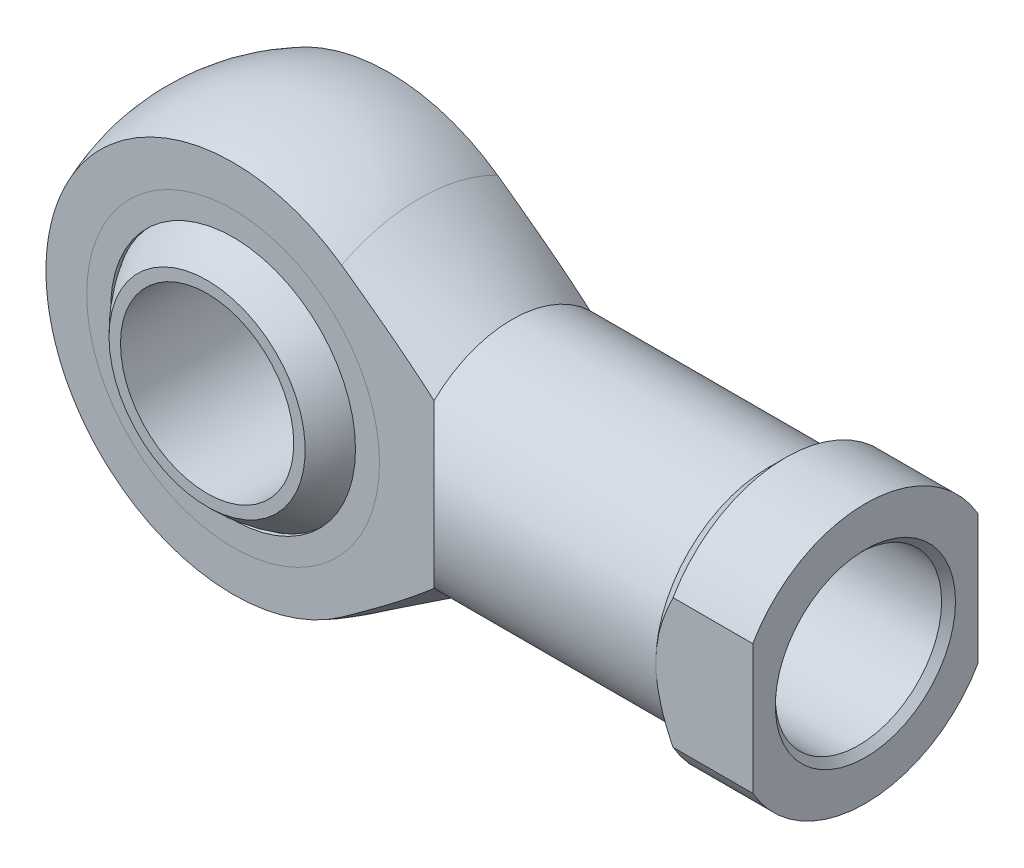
ISO-10303-21;
HEADER;
FILE_DESCRIPTION(('STEP AP214'),'2;1');
FILE_NAME('part.step','',(''),(''),'','','');
FILE_SCHEMA(('AUTOMOTIVE_DESIGN { 1 0 10303 214 1 1 1 1 }'));
ENDSEC;
DATA;
#1=APPLICATION_CONTEXT('core data for automotive mechanical design processes');
#2=APPLICATION_PROTOCOL_DEFINITION('international standard','automotive_design',2000,#1);
#3=PRODUCT_CONTEXT('',#1,'mechanical');
#4=PRODUCT('Part','Part','',(#3));
#5=PRODUCT_RELATED_PRODUCT_CATEGORY('part','',(#4));
#6=PRODUCT_DEFINITION_FORMATION('','',#4);
#7=PRODUCT_DEFINITION_CONTEXT('part definition',#1,'design');
#8=PRODUCT_DEFINITION('design','',#6,#7);
#9=PRODUCT_DEFINITION_SHAPE('','',#8);
#10=(LENGTH_UNIT() NAMED_UNIT(*) SI_UNIT(.MILLI.,.METRE.));
#11=(NAMED_UNIT(*) PLANE_ANGLE_UNIT() SI_UNIT($,.RADIAN.));
#12=(NAMED_UNIT(*) SI_UNIT($,.STERADIAN.) SOLID_ANGLE_UNIT());
#13=UNCERTAINTY_MEASURE_WITH_UNIT(LENGTH_MEASURE(1.E-05),#10,'distance_accuracy_value','');
#14=(GEOMETRIC_REPRESENTATION_CONTEXT(3) GLOBAL_UNCERTAINTY_ASSIGNED_CONTEXT((#13)) GLOBAL_UNIT_ASSIGNED_CONTEXT((#10,
#11,#12)) REPRESENTATION_CONTEXT('',''));
#15=CARTESIAN_POINT('',(0.,0.,0.));
#16=DIRECTION('',(0.,0.,1.));
#17=DIRECTION('',(1.,0.,0.));
#18=AXIS2_PLACEMENT_3D('',#15,#16,#17);
#19=CARTESIAN_POINT('',(0.,0.,0.));
#20=DIRECTION('',(0.,1.,0.));
#21=DIRECTION('',(1.,0.,0.));
#22=AXIS2_PLACEMENT_3D('',#19,#20,#21);
#23=SPHERICAL_SURFACE('',#22,41.25);
#24=CARTESIAN_POINT('',(0.,0.,0.));
#25=DIRECTION('',(0.,0.,-1.));
#26=DIRECTION('',(-1.,0.,0.));
#27=AXIS2_PLACEMENT_3D('',#24,#25,#26);
#28=SPHERICAL_SURFACE('',#27,41.25);
#29=CARTESIAN_POINT('',(0.,0.,30.));
#30=DIRECTION('',(0.,0.,-1.));
#31=DIRECTION('',(-1.,0.,0.));
#32=AXIS2_PLACEMENT_3D('',#29,#30,#31);
#33=CIRCLE('',#32,28.3118791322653);
#34=CARTESIAN_POINT('',(-28.3118791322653,0.,30.));
#35=VERTEX_POINT('',#34);
#36=EDGE_CURVE('P0_E26',#35,#35,#33,.F.);
#37=ORIENTED_EDGE('',*,*,#36,.F.);
#38=EDGE_LOOP('',(#37));
#39=FACE_BOUND('',#38,.T.);
#40=CARTESIAN_POINT('',(0.,0.,-30.));
#41=DIRECTION('',(0.,0.,1.));
#42=DIRECTION('',(1.,0.,0.));
#43=AXIS2_PLACEMENT_3D('',#40,#41,#42);
#44=CIRCLE('',#43,28.3118791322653);
#45=CARTESIAN_POINT('',(28.3118791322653,0.,-30.));
#46=VERTEX_POINT('',#45);
#47=EDGE_CURVE('P0_E10',#46,#46,#44,.F.);
#48=ORIENTED_EDGE('',*,*,#47,.F.);
#49=EDGE_LOOP('',(#48));
#50=FACE_BOUND('',#49,.T.);
#51=ADVANCED_FACE('P0_F14',(#39,#50),#28,.T.);
#52=CARTESIAN_POINT('',(0.,0.,-41.25));
#53=DIRECTION('',(0.,0.,1.));
#54=DIRECTION('',(1.,0.,0.));
#55=AXIS2_PLACEMENT_3D('',#52,#53,#54);
#56=CYLINDRICAL_SURFACE('',#55,25.);
#57=CARTESIAN_POINT('',(0.,0.,30.));
#58=DIRECTION('',(0.,0.,-1.));
#59=DIRECTION('',(-1.,0.,0.));
#60=AXIS2_PLACEMENT_3D('',#57,#58,#59);
#61=CIRCLE('',#60,25.);
#62=CARTESIAN_POINT('',(-25.,0.,30.));
#63=VERTEX_POINT('',#62);
#64=EDGE_CURVE('P0_E17',#63,#63,#61,.F.);
#65=ORIENTED_EDGE('',*,*,#64,.T.);
#66=EDGE_LOOP('',(#65));
#67=FACE_BOUND('',#66,.T.);
#68=CARTESIAN_POINT('',(0.,0.,-30.));
#69=DIRECTION('',(0.,0.,1.));
#70=DIRECTION('',(1.,0.,0.));
#71=AXIS2_PLACEMENT_3D('',#68,#69,#70);
#72=CIRCLE('',#71,25.);
#73=CARTESIAN_POINT('',(25.,0.,-30.));
#74=VERTEX_POINT('',#73);
#75=EDGE_CURVE('P0_E21',#74,#74,#72,.F.);
#76=ORIENTED_EDGE('',*,*,#75,.T.);
#77=EDGE_LOOP('',(#76));
#78=FACE_BOUND('',#77,.T.);
#79=ADVANCED_FACE('P0_F34',(#67,#78),#56,.F.);
#80=CARTESIAN_POINT('',(-41.25,-41.25,-30.));
#81=DIRECTION('',(0.,0.,1.));
#82=DIRECTION('',(1.,0.,0.));
#83=AXIS2_PLACEMENT_3D('',#80,#81,#82);
#84=PLANE('',#83);
#85=ORIENTED_EDGE('',*,*,#47,.T.);
#86=EDGE_LOOP('',(#85));
#87=FACE_BOUND('',#86,.T.);
#88=ORIENTED_EDGE('',*,*,#75,.F.);
#89=EDGE_LOOP('',(#88));
#90=FACE_BOUND('',#89,.T.);
#91=ADVANCED_FACE('P0_F39',(#87,#90),#84,.F.);
#92=CARTESIAN_POINT('',(-41.25,-41.25,30.));
#93=DIRECTION('',(0.,0.,-1.));
#94=DIRECTION('',(-1.,0.,0.));
#95=AXIS2_PLACEMENT_3D('',#92,#93,#94);
#96=PLANE('',#95);
#97=ORIENTED_EDGE('',*,*,#36,.T.);
#98=EDGE_LOOP('',(#97));
#99=FACE_BOUND('',#98,.T.);
#100=ORIENTED_EDGE('',*,*,#64,.F.);
#101=EDGE_LOOP('',(#100));
#102=FACE_BOUND('',#101,.T.);
#103=ADVANCED_FACE('P0_F37',(#99,#102),#96,.F.);
#104=CLOSED_SHELL('',(#51,#79,#91,#103));
#105=MANIFOLD_SOLID_BREP('P0_B1',#104);
#106=CARTESIAN_POINT('',(0.,0.,22.5));
#107=DIRECTION('',(0.,0.,1.));
#108=DIRECTION('',(1.,0.,0.));
#109=AXIS2_PLACEMENT_3D('',#106,#107,#108);
#110=PLANE('',#109);
#111=CARTESIAN_POINT('',(0.,0.,22.5));
#112=DIRECTION('',(0.,0.,1.));
#113=DIRECTION('',(1.,0.,0.));
#114=AXIS2_PLACEMENT_3D('',#111,#112,#113);
#115=CIRCLE('',#114,42.25);
#116=CARTESIAN_POINT('',(42.25,0.,22.5));
#117=VERTEX_POINT('',#116);
#118=EDGE_CURVE('P1_E10',#117,#117,#115,.T.);
#119=ORIENTED_EDGE('',*,*,#118,.T.);
#120=EDGE_LOOP('',(#119));
#121=FACE_BOUND('',#120,.T.);
#122=CARTESIAN_POINT('',(0.,0.,22.5));
#123=DIRECTION('',(0.,0.,1.));
#124=DIRECTION('',(1.,0.,0.));
#125=AXIS2_PLACEMENT_3D('',#122,#123,#124);
#126=CIRCLE('',#125,35.325);
#127=CARTESIAN_POINT('',(35.325,0.,22.5));
#128=VERTEX_POINT('',#127);
#129=EDGE_CURVE('P1_E25',#128,#128,#126,.T.);
#130=ORIENTED_EDGE('',*,*,#129,.F.);
#131=EDGE_LOOP('',(#130));
#132=FACE_BOUND('',#131,.T.);
#133=ADVANCED_FACE('P1_F14',(#121,#132),#110,.T.);
#134=CARTESIAN_POINT('',(0.,0.,21.3));
#135=DIRECTION('',(0.,0.,1.));
#136=DIRECTION('',(1.,0.,0.));
#137=AXIS2_PLACEMENT_3D('',#134,#135,#136);
#138=PLANE('',#137);
#139=CARTESIAN_POINT('',(0.,0.,21.3));
#140=DIRECTION('',(0.,0.,1.));
#141=DIRECTION('',(1.,0.,0.));
#142=AXIS2_PLACEMENT_3D('',#139,#140,#141);
#143=CIRCLE('',#142,42.25);
#144=CARTESIAN_POINT('',(42.25,0.,21.3));
#145=VERTEX_POINT('',#144);
#146=EDGE_CURVE('P1_E18',#145,#145,#143,.T.);
#147=ORIENTED_EDGE('',*,*,#146,.F.);
#148=EDGE_LOOP('',(#147));
#149=FACE_BOUND('',#148,.T.);
#150=CARTESIAN_POINT('',(0.,0.,21.3));
#151=DIRECTION('',(0.,0.,1.));
#152=DIRECTION('',(1.,0.,0.));
#153=AXIS2_PLACEMENT_3D('',#150,#151,#152);
#154=CIRCLE('',#153,35.325);
#155=CARTESIAN_POINT('',(35.325,0.,21.3));
#156=VERTEX_POINT('',#155);
#157=EDGE_CURVE('P1_E27',#156,#156,#154,.T.);
#158=ORIENTED_EDGE('',*,*,#157,.T.);
#159=EDGE_LOOP('',(#158));
#160=FACE_BOUND('',#159,.T.);
#161=ADVANCED_FACE('P1_F37',(#149,#160),#138,.F.);
#162=CARTESIAN_POINT('',(0.,0.,22.5));
#163=DIRECTION('',(0.,0.,-1.));
#164=DIRECTION('',(-1.,0.,0.));
#165=AXIS2_PLACEMENT_3D('',#162,#163,#164);
#166=CYLINDRICAL_SURFACE('',#165,42.25);
#167=ORIENTED_EDGE('',*,*,#118,.F.);
#168=EDGE_LOOP('',(#167));
#169=FACE_BOUND('',#168,.T.);
#170=ORIENTED_EDGE('',*,*,#146,.T.);
#171=EDGE_LOOP('',(#170));
#172=FACE_BOUND('',#171,.T.);
#173=ADVANCED_FACE('P1_F16',(#169,#172),#166,.T.);
#174=CARTESIAN_POINT('',(0.,0.,22.5));
#175=DIRECTION('',(0.,0.,-1.));
#176=DIRECTION('',(-1.,0.,0.));
#177=AXIS2_PLACEMENT_3D('',#174,#175,#176);
#178=CYLINDRICAL_SURFACE('',#177,35.325);
#179=ORIENTED_EDGE('',*,*,#129,.T.);
#180=EDGE_LOOP('',(#179));
#181=FACE_BOUND('',#180,.T.);
#182=ORIENTED_EDGE('',*,*,#157,.F.);
#183=EDGE_LOOP('',(#182));
#184=FACE_BOUND('',#183,.T.);
#185=ADVANCED_FACE('P1_F33',(#181,#184),#178,.F.);
#186=CLOSED_SHELL('',(#133,#161,#173,#185));
#187=MANIFOLD_SOLID_BREP('P1_B1',#186);
#188=CARTESIAN_POINT('',(0.,0.,-21.3));
#189=DIRECTION('',(0.,0.,1.));
#190=DIRECTION('',(1.,0.,0.));
#191=AXIS2_PLACEMENT_3D('',#188,#189,#190);
#192=PLANE('',#191);
#193=CARTESIAN_POINT('',(0.,0.,-21.3));
#194=DIRECTION('',(0.,0.,1.));
#195=DIRECTION('',(1.,0.,0.));
#196=AXIS2_PLACEMENT_3D('',#193,#194,#195);
#197=CIRCLE('',#196,42.25);
#198=CARTESIAN_POINT('',(42.25,0.,-21.3));
#199=VERTEX_POINT('',#198);
#200=EDGE_CURVE('P2_E10',#199,#199,#197,.T.);
#201=ORIENTED_EDGE('',*,*,#200,.T.);
#202=EDGE_LOOP('',(#201));
#203=FACE_BOUND('',#202,.T.);
#204=CARTESIAN_POINT('',(0.,0.,-21.3));
#205=DIRECTION('',(0.,0.,1.));
#206=DIRECTION('',(1.,0.,0.));
#207=AXIS2_PLACEMENT_3D('',#204,#205,#206);
#208=CIRCLE('',#207,35.325);
#209=CARTESIAN_POINT('',(35.325,0.,-21.3));
#210=VERTEX_POINT('',#209);
#211=EDGE_CURVE('P2_E25',#210,#210,#208,.T.);
#212=ORIENTED_EDGE('',*,*,#211,.F.);
#213=EDGE_LOOP('',(#212));
#214=FACE_BOUND('',#213,.T.);
#215=ADVANCED_FACE('P2_F14',(#203,#214),#192,.T.);
#216=CARTESIAN_POINT('',(0.,0.,-22.5));
#217=DIRECTION('',(0.,0.,1.));
#218=DIRECTION('',(1.,0.,0.));
#219=AXIS2_PLACEMENT_3D('',#216,#217,#218);
#220=PLANE('',#219);
#221=CARTESIAN_POINT('',(0.,0.,-22.5));
#222=DIRECTION('',(0.,0.,1.));
#223=DIRECTION('',(1.,0.,0.));
#224=AXIS2_PLACEMENT_3D('',#221,#222,#223);
#225=CIRCLE('',#224,42.25);
#226=CARTESIAN_POINT('',(42.25,0.,-22.5));
#227=VERTEX_POINT('',#226);
#228=EDGE_CURVE('P2_E18',#227,#227,#225,.T.);
#229=ORIENTED_EDGE('',*,*,#228,.F.);
#230=EDGE_LOOP('',(#229));
#231=FACE_BOUND('',#230,.T.);
#232=CARTESIAN_POINT('',(0.,0.,-22.5));
#233=DIRECTION('',(0.,0.,1.));
#234=DIRECTION('',(1.,0.,0.));
#235=AXIS2_PLACEMENT_3D('',#232,#233,#234);
#236=CIRCLE('',#235,35.325);
#237=CARTESIAN_POINT('',(35.325,0.,-22.5));
#238=VERTEX_POINT('',#237);
#239=EDGE_CURVE('P2_E27',#238,#238,#236,.T.);
#240=ORIENTED_EDGE('',*,*,#239,.T.);
#241=EDGE_LOOP('',(#240));
#242=FACE_BOUND('',#241,.T.);
#243=ADVANCED_FACE('P2_F37',(#231,#242),#220,.F.);
#244=CARTESIAN_POINT('',(0.,0.,-21.3));
#245=DIRECTION('',(0.,0.,-1.));
#246=DIRECTION('',(-1.,0.,0.));
#247=AXIS2_PLACEMENT_3D('',#244,#245,#246);
#248=CYLINDRICAL_SURFACE('',#247,42.25);
#249=ORIENTED_EDGE('',*,*,#200,.F.);
#250=EDGE_LOOP('',(#249));
#251=FACE_BOUND('',#250,.T.);
#252=ORIENTED_EDGE('',*,*,#228,.T.);
#253=EDGE_LOOP('',(#252));
#254=FACE_BOUND('',#253,.T.);
#255=ADVANCED_FACE('P2_F16',(#251,#254),#248,.T.);
#256=CARTESIAN_POINT('',(0.,0.,-21.3));
#257=DIRECTION('',(0.,0.,-1.));
#258=DIRECTION('',(-1.,0.,0.));
#259=AXIS2_PLACEMENT_3D('',#256,#257,#258);
#260=CYLINDRICAL_SURFACE('',#259,35.325);
#261=ORIENTED_EDGE('',*,*,#211,.T.);
#262=EDGE_LOOP('',(#261));
#263=FACE_BOUND('',#262,.T.);
#264=ORIENTED_EDGE('',*,*,#239,.F.);
#265=EDGE_LOOP('',(#264));
#266=FACE_BOUND('',#265,.T.);
#267=ADVANCED_FACE('P2_F33',(#263,#266),#260,.F.);
#268=CLOSED_SHELL('',(#215,#243,#255,#267));
#269=MANIFOLD_SOLID_BREP('P2_B1',#268);
#270=CARTESIAN_POINT('',(0.,0.,0.));
#271=DIRECTION('',(0.,1.,0.));
#272=DIRECTION('',(1.,0.,0.));
#273=AXIS2_PLACEMENT_3D('',#270,#271,#272);
#274=SPHERICAL_SURFACE('',#273,41.25);
#275=CARTESIAN_POINT('',(0.,0.,0.));
#276=DIRECTION('',(0.,0.,1.));
#277=DIRECTION('',(1.,0.,0.));
#278=AXIS2_PLACEMENT_3D('',#275,#276,#277);
#279=SPHERICAL_SURFACE('',#278,41.25);
#280=CARTESIAN_POINT('',(0.,0.,21.3));
#281=DIRECTION('',(0.,0.,1.));
#282=DIRECTION('',(1.,0.,0.));
#283=AXIS2_PLACEMENT_3D('',#280,#281,#282);
#284=CIRCLE('',#283,35.3252388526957);
#285=CARTESIAN_POINT('',(35.3252388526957,0.,21.3));
#286=VERTEX_POINT('',#285);
#287=EDGE_CURVE('P3_E73',#286,#286,#284,.F.);
#288=ORIENTED_EDGE('',*,*,#287,.F.);
#289=EDGE_LOOP('',(#288));
#290=FACE_BOUND('',#289,.T.);
#291=CARTESIAN_POINT('',(0.,0.,-21.3));
#292=DIRECTION('',(0.,0.,-1.));
#293=DIRECTION('',(-1.,0.,0.));
#294=AXIS2_PLACEMENT_3D('',#291,#292,#293);
#295=CIRCLE('',#294,35.3252388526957);
#296=CARTESIAN_POINT('',(-35.3252388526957,0.,-21.3));
#297=VERTEX_POINT('',#296);
#298=EDGE_CURVE('P3_E20',#297,#297,#295,.F.);
#299=ORIENTED_EDGE('',*,*,#298,.F.);
#300=EDGE_LOOP('',(#299));
#301=FACE_BOUND('',#300,.T.);
#302=ADVANCED_FACE('P3_F16',(#290,#301),#279,.F.);
#303=CARTESIAN_POINT('',(-58.,-58.5,-22.5));
#304=DIRECTION('',(0.,0.,1.));
#305=DIRECTION('',(1.,0.,0.));
#306=AXIS2_PLACEMENT_3D('',#303,#304,#305);
#307=PLANE('',#306);
#308=CARTESIAN_POINT('',(0.,0.,-22.5));
#309=DIRECTION('',(0.,0.,1.));
#310=DIRECTION('',(1.,0.,0.));
#311=AXIS2_PLACEMENT_3D('',#308,#309,#310);
#312=CIRCLE('',#311,54.);
#313=CARTESIAN_POINT('',(31.3167465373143,43.9916058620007,-22.5));
#314=VERTEX_POINT('',#313);
#315=CARTESIAN_POINT('',(31.3167465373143,-43.9916058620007,-22.5));
#316=VERTEX_POINT('',#315);
#317=EDGE_CURVE('P3_E11',#314,#316,#312,.T.);
#318=ORIENTED_EDGE('',*,*,#317,.F.);
#319=CARTESIAN_POINT('',(-48.2765312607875,-97.2894092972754,-22.5));
#320=CARTESIAN_POINT('',(-46.068566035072,-95.8530644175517,-22.5));
#321=CARTESIAN_POINT('',(-43.8613238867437,-94.4156069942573,-22.5));
#322=CARTESIAN_POINT('',(-39.448531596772,-91.5380926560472,-22.5));
#323=CARTESIAN_POINT('',(-37.2429814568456,-90.0980357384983,-22.5));
#324=CARTESIAN_POINT('',(-32.8333747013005,-87.2146574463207,-22.5));
#325=CARTESIAN_POINT('',(-30.6293184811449,-85.7713354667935,-22.5));
#326=CARTESIAN_POINT('',(-26.223465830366,-82.8812479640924,-22.5));
#327=CARTESIAN_POINT('',(-24.0216693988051,-81.4344824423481,-22.5));
#328=CARTESIAN_POINT('',(-19.6072954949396,-78.5280973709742,-22.5));
#329=CARTESIAN_POINT('',(-17.3947341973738,-77.0684532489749,-22.5));
#330=CARTESIAN_POINT('',(-12.9727763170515,-74.14437944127,-22.5));
#331=CARTESIAN_POINT('',(-10.7633797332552,-72.6799497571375,-22.5));
#332=CARTESIAN_POINT('',(-6.34877930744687,-69.745674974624,-22.5));
#333=CARTESIAN_POINT('',(-4.14357475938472,-68.2758309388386,-22.5));
#334=CARTESIAN_POINT('',(0.262259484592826,-65.3293121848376,-22.5));
#335=CARTESIAN_POINT('',(2.46288919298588,-63.8526374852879,-22.5));
#336=CARTESIAN_POINT('',(6.97251272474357,-60.8141884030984,-22.5));
#337=CARTESIAN_POINT('',(9.28120867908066,-59.2519717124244,-22.5));
#338=CARTESIAN_POINT('',(13.8908374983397,-56.1160529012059,-22.5));
#339=CARTESIAN_POINT('',(16.191770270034,-54.5423506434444,-22.5));
#340=CARTESIAN_POINT('',(19.6363070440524,-52.1703684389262,-22.5));
#341=CARTESIAN_POINT('',(20.7836830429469,-51.3775650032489,-22.5));
#342=CARTESIAN_POINT('',(23.075539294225,-49.7877846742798,-22.5));
#343=CARTESIAN_POINT('',(24.220019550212,-48.9908077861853,-22.5));
#344=CARTESIAN_POINT('',(26.5056027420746,-47.3921143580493,-22.5));
#345=CARTESIAN_POINT('',(27.6467058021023,-46.5903979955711,-22.5));
#346=CARTESIAN_POINT('',(29.9250356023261,-44.9814745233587,-22.5));
#347=CARTESIAN_POINT('',(31.0622623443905,-44.1742674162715,-22.5));
#348=CARTESIAN_POINT('',(33.328403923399,-42.5561773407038,-22.5));
#349=CARTESIAN_POINT('',(34.4573338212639,-41.7453154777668,-22.5));
#350=CARTESIAN_POINT('',(36.7098569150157,-40.1162009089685,-22.5));
#351=CARTESIAN_POINT('',(37.833450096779,-39.2979481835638,-22.5));
#352=CARTESIAN_POINT('',(40.074441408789,-37.6525919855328,-22.5));
#353=CARTESIAN_POINT('',(41.1918384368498,-36.8254870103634,-22.5));
#354=CARTESIAN_POINT('',(43.4188830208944,-35.1609119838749,-22.5));
#355=CARTESIAN_POINT('',(44.5285306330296,-34.3234420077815,-22.5));
#356=CARTESIAN_POINT('',(46.7371695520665,-32.6368797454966,-22.5));
#357=CARTESIAN_POINT('',(47.8361706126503,-31.787800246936,-22.5));
#358=CARTESIAN_POINT('',(50.0223458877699,-30.0744249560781,-22.5));
#359=CARTESIAN_POINT('',(51.1095196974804,-29.2101286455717,-22.5));
#360=CARTESIAN_POINT('',(52.728702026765,-27.8997180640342,-22.5));
#361=CARTESIAN_POINT('',(53.2664200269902,-27.4606536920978,-22.5));
#362=CARTESIAN_POINT('',(54.3375046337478,-26.5772524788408,-22.5));
#363=CARTESIAN_POINT('',(54.8708712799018,-26.1329156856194,-22.5));
#364=CARTESIAN_POINT('',(55.9325779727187,-25.2383513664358,-22.5));
#365=CARTESIAN_POINT('',(56.4609183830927,-24.7881242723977,-22.5));
#366=CARTESIAN_POINT('',(57.5118256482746,-23.8809899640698,-22.5));
#367=CARTESIAN_POINT('',(58.0343926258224,-23.4240828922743,-22.5));
#368=CARTESIAN_POINT('',(58.7374398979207,-22.8002519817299,-22.5));
#369=CARTESIAN_POINT('',(58.9208664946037,-22.6366430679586,-22.5));
#370=CARTESIAN_POINT('',(59.2868263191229,-22.3084262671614,-22.5));
#371=CARTESIAN_POINT('',(59.4693595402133,-22.1438183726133,-22.5));
#372=CARTESIAN_POINT('',(60.0155531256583,-21.6484159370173,-22.5));
#373=CARTESIAN_POINT('',(60.377794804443,-21.3160538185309,-22.5));
#374=CARTESIAN_POINT('',(61.0980600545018,-20.646695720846,-22.5));
#375=CARTESIAN_POINT('',(61.4560830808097,-20.3096991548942,-22.5));
#376=CARTESIAN_POINT('',(62.1672980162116,-19.630645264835,-22.5));
#377=CARTESIAN_POINT('',(62.5204899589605,-19.2885879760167,-22.5));
#378=CARTESIAN_POINT('',(63.2221097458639,-18.5981571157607,-22.5));
#379=CARTESIAN_POINT('',(63.5705260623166,-18.2497718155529,-22.5));
#380=CARTESIAN_POINT('',(64.2610283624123,-17.5467834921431,-22.5));
#381=CARTESIAN_POINT('',(64.6031144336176,-17.1921805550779,-22.5));
#382=CARTESIAN_POINT('',(65.2799630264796,-16.4760998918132,-22.5));
#383=CARTESIAN_POINT('',(65.6147261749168,-16.1146227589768,-22.5));
#384=CARTESIAN_POINT('',(66.2757844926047,-15.383998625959,-22.5));
#385=CARTESIAN_POINT('',(66.6020798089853,-15.0148517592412,-22.5));
#386=CARTESIAN_POINT('',(67.1892686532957,-14.3325187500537,-22.5));
#387=CARTESIAN_POINT('',(67.4517249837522,-14.0206784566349,-22.5));
#388=CARTESIAN_POINT('',(67.9688769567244,-13.3906291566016,-22.5));
#389=CARTESIAN_POINT('',(68.2235728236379,-13.0724203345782,-22.5));
#390=CARTESIAN_POINT('',(68.7241542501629,-12.4289258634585,-22.5));
#391=CARTESIAN_POINT('',(68.9700362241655,-12.1036374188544,-22.5));
#392=CARTESIAN_POINT('',(69.4515074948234,-11.4455020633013,-22.5));
#393=CARTESIAN_POINT('',(69.6870966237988,-11.11265502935,-22.5));
#394=CARTESIAN_POINT('',(70.1455564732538,-10.4399496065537,-22.5));
#395=CARTESIAN_POINT('',(70.3684678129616,-10.1001189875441,-22.5));
#396=CARTESIAN_POINT('',(70.8004978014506,-9.41180965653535,-22.5));
#397=CARTESIAN_POINT('',(71.0096176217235,-9.06333168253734,-22.5));
#398=CARTESIAN_POINT('',(71.4116349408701,-8.357555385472,-22.5));
#399=CARTESIAN_POINT('',(71.6045482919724,-8.00026613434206,-22.5));
#400=CARTESIAN_POINT('',(71.9718179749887,-7.27615119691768,-22.5));
#401=CARTESIAN_POINT('',(72.1461708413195,-6.90932374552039,-22.5));
#402=CARTESIAN_POINT('',(72.4944494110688,-6.11821857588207,-22.5));
#403=CARTESIAN_POINT('',(72.6654247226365,-5.69262914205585,-22.5));
#404=CARTESIAN_POINT('',(72.9753034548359,-4.83003951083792,-22.5));
#405=CARTESIAN_POINT('',(73.1142211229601,-4.39304447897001,-22.5));
#406=CARTESIAN_POINT('',(73.3551235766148,-3.51024132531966,-22.5));
#407=CARTESIAN_POINT('',(73.4572122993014,-3.06446180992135,-22.5));
#408=CARTESIAN_POINT('',(73.6208982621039,-2.16568956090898,-22.5));
#409=CARTESIAN_POINT('',(73.682524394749,-1.71270221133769,-22.5));
#410=CARTESIAN_POINT('',(73.7410108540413,-1.04883693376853,-22.5));
#411=CARTESIAN_POINT('',(73.7548742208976,-0.839354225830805,-22.5));
#412=CARTESIAN_POINT('',(73.7733878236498,-0.419925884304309,-22.5));
#413=CARTESIAN_POINT('',(73.7780355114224,-0.209980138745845,-22.5));
#414=CARTESIAN_POINT('',(73.7780131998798,0.470424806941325,-22.5));
#415=CARTESIAN_POINT('',(73.7546361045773,0.941022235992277,-22.5));
#416=CARTESIAN_POINT('',(73.6622488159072,1.87790630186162,-22.5));
#417=CARTESIAN_POINT('',(73.5932054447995,2.34418955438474,-22.5));
#418=CARTESIAN_POINT('',(73.4125142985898,3.26951291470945,-22.5));
#419=CARTESIAN_POINT('',(73.3007648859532,3.72853300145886,-22.5));
#420=CARTESIAN_POINT('',(73.0392896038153,4.63546149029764,-22.5));
#421=CARTESIAN_POINT('',(72.8895643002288,5.08337005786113,-22.5));
#422=CARTESIAN_POINT('',(72.480923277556,6.16942421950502,-22.5));
#423=CARTESIAN_POINT('',(72.2034273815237,6.80057014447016,-22.5));
#424=CARTESIAN_POINT('',(71.5933088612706,8.03565786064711,-22.5));
#425=CARTESIAN_POINT('',(71.2606479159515,8.63958036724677,-22.5));
#426=CARTESIAN_POINT('',(70.7290818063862,9.52718722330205,-22.5));
#427=CARTESIAN_POINT('',(70.546069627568,9.82057196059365,-22.5));
#428=CARTESIAN_POINT('',(70.1705546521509,10.4012185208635,-22.5));
#429=CARTESIAN_POINT('',(69.9780518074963,10.6884803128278,-22.5));
#430=CARTESIAN_POINT('',(69.5847849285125,11.2571086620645,-22.5));
#431=CARTESIAN_POINT('',(69.3840241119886,11.5384774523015,-22.5));
#432=CARTESIAN_POINT('',(68.9751454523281,12.0958021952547,-22.5));
#433=CARTESIAN_POINT('',(68.7670276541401,12.3717581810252,-22.5));
#434=CARTESIAN_POINT('',(68.185256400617,13.1243636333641,-22.5));
#435=CARTESIAN_POINT('',(67.804860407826,13.5958094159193,-22.5));
#436=CARTESIAN_POINT('',(67.0277960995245,14.5251434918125,-22.5));
#437=CARTESIAN_POINT('',(66.631125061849,14.9830294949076,-22.5));
#438=CARTESIAN_POINT('',(65.8241728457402,15.8871330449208,-22.5));
#439=CARTESIAN_POINT('',(65.4138832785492,16.3333430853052,-22.5));
#440=CARTESIAN_POINT('',(64.5822136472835,17.2152303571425,-22.5));
#441=CARTESIAN_POINT('',(64.1608341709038,17.6509081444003,-22.5));
#442=CARTESIAN_POINT('',(63.3076932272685,18.5140822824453,-22.5));
#443=CARTESIAN_POINT('',(62.8759087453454,18.9415558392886,-22.5));
#444=CARTESIAN_POINT('',(62.0043869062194,19.7883123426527,-22.5));
#445=CARTESIAN_POINT('',(61.5646494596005,20.2075951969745,-22.5));
#446=CARTESIAN_POINT('',(60.6785248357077,21.0387704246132,-22.5));
#447=CARTESIAN_POINT('',(60.2321398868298,21.4506651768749,-22.5));
#448=CARTESIAN_POINT('',(59.3335043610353,22.2680119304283,-22.5));
#449=CARTESIAN_POINT('',(58.8812536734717,22.6734638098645,-22.5));
#450=CARTESIAN_POINT('',(57.5079347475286,23.8891539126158,-22.5));
#451=CARTESIAN_POINT('',(56.5790536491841,24.6905729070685,-22.5));
#452=CARTESIAN_POINT('',(54.7054297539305,26.2746889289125,-22.5));
#453=CARTESIAN_POINT('',(53.7606859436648,27.0573847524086,-22.5));
#454=CARTESIAN_POINT('',(52.3349834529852,28.2193058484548,-22.5));
#455=CARTESIAN_POINT('',(51.858701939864,28.6042898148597,-22.5));
#456=CARTESIAN_POINT('',(50.9033500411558,29.3707826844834,-22.5));
#457=CARTESIAN_POINT('',(50.4242796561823,29.7522915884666,-22.5));
#458=CARTESIAN_POINT('',(49.4636567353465,30.5121354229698,-22.5));
#459=CARTESIAN_POINT('',(48.9821042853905,30.8904704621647,-22.5));
#460=CARTESIAN_POINT('',(48.016746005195,31.6442527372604,-22.5));
#461=CARTESIAN_POINT('',(47.532940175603,32.0196999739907,-22.5));
#462=CARTESIAN_POINT('',(46.0606736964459,33.1558200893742,-22.5));
#463=CARTESIAN_POINT('',(45.0690088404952,33.9123435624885,-22.5));
#464=CARTESIAN_POINT('',(43.0787248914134,35.4161957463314,-22.5));
#465=CARTESIAN_POINT('',(42.0801057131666,36.1635243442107,-22.5));
#466=CARTESIAN_POINT('',(40.077020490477,37.6503847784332,-22.5));
#467=CARTESIAN_POINT('',(39.0725542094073,38.389916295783,-22.5));
#468=CARTESIAN_POINT('',(37.0587125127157,39.8622694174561,-22.5));
#469=CARTESIAN_POINT('',(36.0493370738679,40.5950909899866,-22.5));
#470=CARTESIAN_POINT('',(34.0262251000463,42.0550603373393,-22.5));
#471=CARTESIAN_POINT('',(33.0124878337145,42.7822070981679,-22.5));
#472=CARTESIAN_POINT('',(30.9814051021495,44.2314456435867,-22.5));
#473=CARTESIAN_POINT('',(29.9640596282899,44.9535374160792,-22.5));
#474=CARTESIAN_POINT('',(26.9074010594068,47.1131610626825,-22.5));
#475=CARTESIAN_POINT('',(24.8634137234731,48.5440787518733,-22.5));
#476=CARTESIAN_POINT('',(20.7631322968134,51.3940960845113,-22.5));
#477=CARTESIAN_POINT('',(18.7068253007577,52.8131771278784,-22.5));
#478=CARTESIAN_POINT('',(14.5866700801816,55.6403632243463,-22.5));
#479=CARTESIAN_POINT('',(12.5228218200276,57.0484682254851,-22.5));
#480=CARTESIAN_POINT('',(8.38930375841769,59.8556458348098,-22.5));
#481=CARTESIAN_POINT('',(6.31963457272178,61.2547193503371,-22.5));
#482=CARTESIAN_POINT('',(2.17538644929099,64.0455650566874,-22.5));
#483=CARTESIAN_POINT('',(0.100807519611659,65.4373372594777,-22.5));
#484=CARTESIAN_POINT('',(-3.89737550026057,68.1111317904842,-22.5));
#485=CARTESIAN_POINT('',(-5.82068792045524,69.3935904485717,-22.5));
#486=CARTESIAN_POINT('',(-9.67025785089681,71.9540811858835,-22.5));
#487=CARTESIAN_POINT('',(-11.5965153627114,73.2321132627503,-22.5));
#488=CARTESIAN_POINT('',(-15.4516046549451,75.7844159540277,-22.5));
#489=CARTESIAN_POINT('',(-17.3804365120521,77.0586864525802,-22.5));
#490=CARTESIAN_POINT('',(-21.240268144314,79.6039399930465,-22.5));
#491=CARTESIAN_POINT('',(-23.1712679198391,80.8749230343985,-22.5));
#492=CARTESIAN_POINT('',(-27.0311833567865,83.4114202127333,-22.5));
#493=CARTESIAN_POINT('',(-28.9600951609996,84.6769402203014,-22.5));
#494=CARTESIAN_POINT('',(-32.8195567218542,87.2054803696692,-22.5));
#495=CARTESIAN_POINT('',(-34.7501064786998,88.4685005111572,-22.5));
#496=CARTESIAN_POINT('',(-38.6125712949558,90.9922911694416,-22.5));
#497=CARTESIAN_POINT('',(-40.5444862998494,92.2530617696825,-22.5));
#498=CARTESIAN_POINT('',(-44.4095921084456,94.7726438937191,-22.5));
#499=CARTESIAN_POINT('',(-46.3427829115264,96.0314554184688,-22.5));
#500=CARTESIAN_POINT('',(-48.2765312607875,97.2894092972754,-22.5));
#501=B_SPLINE_CURVE_WITH_KNOTS('',3,(#319,#320,#321,#322,#323,#324,#325,#326,#327,#328,#329,
#330,#331,#332,#333,#334,#335,#336,#337,#338,#339,#340,#341,#342,#343,#344,#345,#346,#347,#348,
#349,#350,#351,#352,#353,#354,#355,#356,#357,#358,#359,#360,#361,#362,#363,#364,#365,#366,#367,
#368,#369,#370,#371,#372,#373,#374,#375,#376,#377,#378,#379,#380,#381,#382,#383,#384,#385,#386,
#387,#388,#389,#390,#391,#392,#393,#394,#395,#396,#397,#398,#399,#400,#401,#402,#403,#404,#405,
#406,#407,#408,#409,#410,#411,#412,#413,#414,#415,#416,#417,#418,#419,#420,#421,#422,#423,#424,
#425,#426,#427,#428,#429,#430,#431,#432,#433,#434,#435,#436,#437,#438,#439,#440,#441,#442,#443,
#444,#445,#446,#447,#448,#449,#450,#451,#452,#453,#454,#455,#456,#457,#458,#459,#460,#461,#462,
#463,#464,#465,#466,#467,#468,#469,#470,#471,#472,#473,#474,#475,#476,#477,#478,#479,#480,#481,
#482,#483,#484,#485,#486,#487,#488,#489,#490,#491,#492,#493,#494,#495,#496,#497,#498,#499,#500),
.UNSPECIFIED.,.F.,.F.,(4,2,2,2,2,2,2,2,2,2,2,2,2,2,2,2,2,2,2,2,2,2,2,2,2,2,2,2,2,2,2,2,2,2,2,2,
2,2,2,2,2,2,2,2,2,2,2,2,2,2,2,2,2,2,2,2,2,2,2,2,2,2,2,2,2,2,2,2,2,2,2,2,2,2,2,2,2,2,2,2,2,2,2,2,
2,2,2,2,2,2,4),(0.,7.90213776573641,15.8042835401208,23.7080380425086,31.611789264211,
39.5637584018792,47.5157249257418,55.4662061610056,63.4166656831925,71.779378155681,
80.1421907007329,84.3260906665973,88.5099854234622,92.6937244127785,96.8774613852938,
101.047306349,105.217162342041,109.387737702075,113.55828281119,117.724554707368,
121.890968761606,123.973551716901,126.056115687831,128.138527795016,130.220895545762,
130.958265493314,131.695641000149,133.170442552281,134.645432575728,136.120412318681,
137.598481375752,139.076529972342,140.554451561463,142.032347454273,143.255003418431,
144.477623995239,145.700736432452,146.923868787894,148.142831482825,149.361690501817,
150.57934307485,151.797222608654,153.172044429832,154.54625405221,155.916554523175,
157.285875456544,157.915523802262,158.545346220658,159.956356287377,161.368392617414,
162.783810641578,164.199207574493,166.263968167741,168.330169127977,169.367379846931,
170.404595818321,171.441411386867,172.478220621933,174.295053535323,176.112191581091,
177.930470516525,179.748653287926,181.571314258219,183.393995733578,185.216079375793,
187.038197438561,190.71831128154,194.398661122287,196.235903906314,198.073146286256,
199.9103254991,201.747504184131,205.489295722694,209.231133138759,212.973123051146,
216.715130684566,220.457792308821,224.200462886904,231.685611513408,239.180883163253,
246.676190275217,254.170732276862,261.665261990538,268.600273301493,275.535288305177,
282.470514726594,289.405742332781,296.326735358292,303.247729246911,310.168460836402,
317.089189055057),.UNSPECIFIED.);
#502=CARTESIAN_POINT('',(58.,23.4520787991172,-22.5));
#503=VERTEX_POINT('',#502);
#504=EDGE_CURVE('P3_E102',#503,#314,#501,.T.);
#505=ORIENTED_EDGE('',*,*,#504,.F.);
#506=DIRECTION('',(0.,1.,0.));
#507=VECTOR('',#506,1.);
#508=CARTESIAN_POINT('',(58.,-58.5,-22.5));
#509=LINE('',#508,#507);
#510=CARTESIAN_POINT('',(58.,-23.4520787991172,-22.5));
#511=VERTEX_POINT('',#510);
#512=EDGE_CURVE('P3_E64',#511,#503,#509,.T.);
#513=ORIENTED_EDGE('',*,*,#512,.F.);
#514=EDGE_CURVE('P3_E33',#316,#511,#501,.T.);
#515=ORIENTED_EDGE('',*,*,#514,.F.);
#516=EDGE_LOOP('',(#318,#505,#513,#515));
#517=FACE_BOUND('',#516,.T.);
#518=CARTESIAN_POINT('',(0.,0.,-22.5));
#519=DIRECTION('',(0.,0.,1.));
#520=DIRECTION('',(1.,0.,0.));
#521=AXIS2_PLACEMENT_3D('',#518,#519,#520);
#522=CIRCLE('',#521,42.25);
#523=CARTESIAN_POINT('',(42.25,0.,-22.5));
#524=VERTEX_POINT('',#523);
#525=EDGE_CURVE('P3_E95',#524,#524,#522,.T.);
#526=ORIENTED_EDGE('',*,*,#525,.T.);
#527=EDGE_LOOP('',(#526));
#528=FACE_BOUND('',#527,.T.);
#529=ADVANCED_FACE('P3_F115',(#517,#528),#307,.F.);
#530=CARTESIAN_POINT('',(58.,0.,0.));
#531=DIRECTION('',(-1.,0.,0.));
#532=DIRECTION('',(0.,0.,1.));
#533=AXIS2_PLACEMENT_3D('',#530,#531,#532);
#534=CONICAL_SURFACE('',#533,32.5,0.564897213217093);
#535=CARTESIAN_POINT('',(31.3167465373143,0.,0.));
#536=DIRECTION('',(-1.,0.,0.));
#537=DIRECTION('',(0.,0.,1.));
#538=AXIS2_PLACEMENT_3D('',#535,#536,#537);
#539=CIRCLE('',#538,49.4116523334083);
#540=CARTESIAN_POINT('',(31.3167465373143,-43.9916058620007,22.5));
#541=VERTEX_POINT('',#540);
#542=EDGE_CURVE('P3_E79',#316,#541,#539,.T.);
#543=ORIENTED_EDGE('',*,*,#542,.F.);
#544=ORIENTED_EDGE('',*,*,#514,.T.);
#545=CARTESIAN_POINT('',(58.,0.,0.));
#546=DIRECTION('',(-1.,0.,0.));
#547=DIRECTION('',(0.,0.,1.));
#548=AXIS2_PLACEMENT_3D('',#545,#546,#547);
#549=CIRCLE('',#548,32.5);
#550=CARTESIAN_POINT('',(58.,-23.4520787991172,22.5));
#551=VERTEX_POINT('',#550);
#552=EDGE_CURVE('P3_E70',#511,#551,#549,.T.);
#553=ORIENTED_EDGE('',*,*,#552,.T.);
#554=CARTESIAN_POINT('',(-48.2765312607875,97.2894092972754,22.5));
#555=CARTESIAN_POINT('',(-46.068566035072,95.8530644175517,22.5));
#556=CARTESIAN_POINT('',(-43.8613238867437,94.4156069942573,22.5));
#557=CARTESIAN_POINT('',(-39.448531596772,91.5380926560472,22.5));
#558=CARTESIAN_POINT('',(-37.2429814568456,90.0980357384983,22.5));
#559=CARTESIAN_POINT('',(-32.8333747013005,87.2146574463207,22.5));
#560=CARTESIAN_POINT('',(-30.6293184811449,85.7713354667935,22.5));
#561=CARTESIAN_POINT('',(-26.223465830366,82.8812479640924,22.5));
#562=CARTESIAN_POINT('',(-24.0216693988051,81.4344824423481,22.5));
#563=CARTESIAN_POINT('',(-19.6072954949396,78.5280973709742,22.5));
#564=CARTESIAN_POINT('',(-17.3947341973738,77.0684532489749,22.5));
#565=CARTESIAN_POINT('',(-12.9727763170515,74.14437944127,22.5));
#566=CARTESIAN_POINT('',(-10.7633797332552,72.6799497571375,22.5));
#567=CARTESIAN_POINT('',(-6.34877930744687,69.745674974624,22.5));
#568=CARTESIAN_POINT('',(-4.14357475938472,68.2758309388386,22.5));
#569=CARTESIAN_POINT('',(0.262259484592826,65.3293121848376,22.5));
#570=CARTESIAN_POINT('',(2.46288919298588,63.8526374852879,22.5));
#571=CARTESIAN_POINT('',(6.97251272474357,60.8141884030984,22.5));
#572=CARTESIAN_POINT('',(9.28120867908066,59.2519717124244,22.5));
#573=CARTESIAN_POINT('',(13.8908374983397,56.1160529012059,22.5));
#574=CARTESIAN_POINT('',(16.191770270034,54.5423506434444,22.5));
#575=CARTESIAN_POINT('',(19.6363070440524,52.1703684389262,22.5));
#576=CARTESIAN_POINT('',(20.7836830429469,51.3775650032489,22.5));
#577=CARTESIAN_POINT('',(23.075539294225,49.7877846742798,22.5));
#578=CARTESIAN_POINT('',(24.220019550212,48.9908077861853,22.5));
#579=CARTESIAN_POINT('',(26.5056027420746,47.3921143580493,22.5));
#580=CARTESIAN_POINT('',(27.6467058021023,46.5903979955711,22.5));
#581=CARTESIAN_POINT('',(29.9250356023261,44.9814745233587,22.5));
#582=CARTESIAN_POINT('',(31.0622623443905,44.1742674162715,22.5));
#583=CARTESIAN_POINT('',(33.328403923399,42.5561773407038,22.5));
#584=CARTESIAN_POINT('',(34.4573338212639,41.7453154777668,22.5));
#585=CARTESIAN_POINT('',(36.7098569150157,40.1162009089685,22.5));
#586=CARTESIAN_POINT('',(37.833450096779,39.2979481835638,22.5));
#587=CARTESIAN_POINT('',(40.074441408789,37.6525919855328,22.5));
#588=CARTESIAN_POINT('',(41.1918384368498,36.8254870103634,22.5));
#589=CARTESIAN_POINT('',(43.4188830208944,35.1609119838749,22.5));
#590=CARTESIAN_POINT('',(44.5285306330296,34.3234420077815,22.5));
#591=CARTESIAN_POINT('',(46.7371695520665,32.6368797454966,22.5));
#592=CARTESIAN_POINT('',(47.8361706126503,31.787800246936,22.5));
#593=CARTESIAN_POINT('',(50.0223458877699,30.0744249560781,22.5));
#594=CARTESIAN_POINT('',(51.1095196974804,29.2101286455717,22.5));
#595=CARTESIAN_POINT('',(52.728702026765,27.8997180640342,22.5));
#596=CARTESIAN_POINT('',(53.2664200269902,27.4606536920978,22.5));
#597=CARTESIAN_POINT('',(54.3375046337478,26.5772524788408,22.5));
#598=CARTESIAN_POINT('',(54.8708712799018,26.1329156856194,22.5));
#599=CARTESIAN_POINT('',(55.9325779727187,25.2383513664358,22.5));
#600=CARTESIAN_POINT('',(56.4609183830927,24.7881242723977,22.5));
#601=CARTESIAN_POINT('',(57.5118256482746,23.8809899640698,22.5));
#602=CARTESIAN_POINT('',(58.0343926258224,23.4240828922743,22.5));
#603=CARTESIAN_POINT('',(58.7374398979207,22.8002519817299,22.5));
#604=CARTESIAN_POINT('',(58.9208664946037,22.6366430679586,22.5));
#605=CARTESIAN_POINT('',(59.2868263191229,22.3084262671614,22.5));
#606=CARTESIAN_POINT('',(59.4693595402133,22.1438183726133,22.5));
#607=CARTESIAN_POINT('',(60.0155531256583,21.6484159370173,22.5));
#608=CARTESIAN_POINT('',(60.377794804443,21.3160538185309,22.5));
#609=CARTESIAN_POINT('',(61.0980600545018,20.646695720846,22.5));
#610=CARTESIAN_POINT('',(61.4560830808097,20.3096991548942,22.5));
#611=CARTESIAN_POINT('',(62.1672980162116,19.630645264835,22.5));
#612=CARTESIAN_POINT('',(62.5204899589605,19.2885879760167,22.5));
#613=CARTESIAN_POINT('',(63.2221097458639,18.5981571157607,22.5));
#614=CARTESIAN_POINT('',(63.5705260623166,18.2497718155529,22.5));
#615=CARTESIAN_POINT('',(64.2610283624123,17.5467834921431,22.5));
#616=CARTESIAN_POINT('',(64.6031144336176,17.1921805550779,22.5));
#617=CARTESIAN_POINT('',(65.2799630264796,16.4760998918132,22.5));
#618=CARTESIAN_POINT('',(65.6147261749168,16.1146227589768,22.5));
#619=CARTESIAN_POINT('',(66.2757844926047,15.383998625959,22.5));
#620=CARTESIAN_POINT('',(66.6020798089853,15.0148517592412,22.5));
#621=CARTESIAN_POINT('',(67.1892686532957,14.3325187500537,22.5));
#622=CARTESIAN_POINT('',(67.4517249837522,14.0206784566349,22.5));
#623=CARTESIAN_POINT('',(67.9688769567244,13.3906291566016,22.5));
#624=CARTESIAN_POINT('',(68.2235728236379,13.0724203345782,22.5));
#625=CARTESIAN_POINT('',(68.7241542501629,12.4289258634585,22.5));
#626=CARTESIAN_POINT('',(68.9700362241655,12.1036374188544,22.5));
#627=CARTESIAN_POINT('',(69.4515074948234,11.4455020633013,22.5));
#628=CARTESIAN_POINT('',(69.6870966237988,11.11265502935,22.5));
#629=CARTESIAN_POINT('',(70.1455564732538,10.4399496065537,22.5));
#630=CARTESIAN_POINT('',(70.3684678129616,10.1001189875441,22.5));
#631=CARTESIAN_POINT('',(70.8004978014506,9.41180965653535,22.5));
#632=CARTESIAN_POINT('',(71.0096176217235,9.06333168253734,22.5));
#633=CARTESIAN_POINT('',(71.4116349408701,8.357555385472,22.5));
#634=CARTESIAN_POINT('',(71.6045482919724,8.00026613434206,22.5));
#635=CARTESIAN_POINT('',(71.9718179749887,7.27615119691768,22.5));
#636=CARTESIAN_POINT('',(72.1461708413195,6.90932374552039,22.5));
#637=CARTESIAN_POINT('',(72.4944494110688,6.11821857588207,22.5));
#638=CARTESIAN_POINT('',(72.6654247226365,5.69262914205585,22.5));
#639=CARTESIAN_POINT('',(72.9753034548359,4.83003951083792,22.5));
#640=CARTESIAN_POINT('',(73.1142211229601,4.39304447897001,22.5));
#641=CARTESIAN_POINT('',(73.3551235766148,3.51024132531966,22.5));
#642=CARTESIAN_POINT('',(73.4572122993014,3.06446180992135,22.5));
#643=CARTESIAN_POINT('',(73.6208982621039,2.16568956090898,22.5));
#644=CARTESIAN_POINT('',(73.682524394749,1.71270221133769,22.5));
#645=CARTESIAN_POINT('',(73.7410108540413,1.04883693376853,22.5));
#646=CARTESIAN_POINT('',(73.7548742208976,0.839354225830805,22.5));
#647=CARTESIAN_POINT('',(73.7733878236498,0.419925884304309,22.5));
#648=CARTESIAN_POINT('',(73.7780355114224,0.209980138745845,22.5));
#649=CARTESIAN_POINT('',(73.7780131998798,-0.470424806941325,22.5));
#650=CARTESIAN_POINT('',(73.7546361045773,-0.941022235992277,22.5));
#651=CARTESIAN_POINT('',(73.6622488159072,-1.87790630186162,22.5));
#652=CARTESIAN_POINT('',(73.5932054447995,-2.34418955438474,22.5));
#653=CARTESIAN_POINT('',(73.4125142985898,-3.26951291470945,22.5));
#654=CARTESIAN_POINT('',(73.3007648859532,-3.72853300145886,22.5));
#655=CARTESIAN_POINT('',(73.0392896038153,-4.63546149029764,22.5));
#656=CARTESIAN_POINT('',(72.8895643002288,-5.08337005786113,22.5));
#657=CARTESIAN_POINT('',(72.480923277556,-6.16942421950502,22.5));
#658=CARTESIAN_POINT('',(72.2034273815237,-6.80057014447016,22.5));
#659=CARTESIAN_POINT('',(71.5933088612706,-8.03565786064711,22.5));
#660=CARTESIAN_POINT('',(71.2606479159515,-8.63958036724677,22.5));
#661=CARTESIAN_POINT('',(70.7290818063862,-9.52718722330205,22.5));
#662=CARTESIAN_POINT('',(70.546069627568,-9.82057196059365,22.5));
#663=CARTESIAN_POINT('',(70.1705546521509,-10.4012185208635,22.5));
#664=CARTESIAN_POINT('',(69.9780518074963,-10.6884803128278,22.5));
#665=CARTESIAN_POINT('',(69.5847849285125,-11.2571086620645,22.5));
#666=CARTESIAN_POINT('',(69.3840241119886,-11.5384774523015,22.5));
#667=CARTESIAN_POINT('',(68.9751454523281,-12.0958021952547,22.5));
#668=CARTESIAN_POINT('',(68.7670276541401,-12.3717581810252,22.5));
#669=CARTESIAN_POINT('',(68.185256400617,-13.1243636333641,22.5));
#670=CARTESIAN_POINT('',(67.804860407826,-13.5958094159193,22.5));
#671=CARTESIAN_POINT('',(67.0277960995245,-14.5251434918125,22.5));
#672=CARTESIAN_POINT('',(66.631125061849,-14.9830294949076,22.5));
#673=CARTESIAN_POINT('',(65.8241728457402,-15.8871330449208,22.5));
#674=CARTESIAN_POINT('',(65.4138832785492,-16.3333430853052,22.5));
#675=CARTESIAN_POINT('',(64.5822136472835,-17.2152303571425,22.5));
#676=CARTESIAN_POINT('',(64.1608341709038,-17.6509081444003,22.5));
#677=CARTESIAN_POINT('',(63.3076932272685,-18.5140822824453,22.5));
#678=CARTESIAN_POINT('',(62.8759087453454,-18.9415558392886,22.5));
#679=CARTESIAN_POINT('',(62.0043869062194,-19.7883123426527,22.5));
#680=CARTESIAN_POINT('',(61.5646494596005,-20.2075951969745,22.5));
#681=CARTESIAN_POINT('',(60.6785248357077,-21.0387704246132,22.5));
#682=CARTESIAN_POINT('',(60.2321398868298,-21.4506651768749,22.5));
#683=CARTESIAN_POINT('',(59.3335043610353,-22.2680119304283,22.5));
#684=CARTESIAN_POINT('',(58.8812536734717,-22.6734638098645,22.5));
#685=CARTESIAN_POINT('',(57.5079347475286,-23.8891539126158,22.5));
#686=CARTESIAN_POINT('',(56.5790536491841,-24.6905729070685,22.5));
#687=CARTESIAN_POINT('',(54.7054297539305,-26.2746889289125,22.5));
#688=CARTESIAN_POINT('',(53.7606859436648,-27.0573847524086,22.5));
#689=CARTESIAN_POINT('',(52.3349834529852,-28.2193058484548,22.5));
#690=CARTESIAN_POINT('',(51.858701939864,-28.6042898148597,22.5));
#691=CARTESIAN_POINT('',(50.9033500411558,-29.3707826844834,22.5));
#692=CARTESIAN_POINT('',(50.4242796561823,-29.7522915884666,22.5));
#693=CARTESIAN_POINT('',(49.4636567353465,-30.5121354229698,22.5));
#694=CARTESIAN_POINT('',(48.9821042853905,-30.8904704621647,22.5));
#695=CARTESIAN_POINT('',(48.016746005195,-31.6442527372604,22.5));
#696=CARTESIAN_POINT('',(47.532940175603,-32.0196999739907,22.5));
#697=CARTESIAN_POINT('',(46.0606736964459,-33.1558200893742,22.5));
#698=CARTESIAN_POINT('',(45.0690088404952,-33.9123435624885,22.5));
#699=CARTESIAN_POINT('',(43.0787248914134,-35.4161957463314,22.5));
#700=CARTESIAN_POINT('',(42.0801057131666,-36.1635243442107,22.5));
#701=CARTESIAN_POINT('',(40.077020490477,-37.6503847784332,22.5));
#702=CARTESIAN_POINT('',(39.0725542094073,-38.389916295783,22.5));
#703=CARTESIAN_POINT('',(37.0587125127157,-39.8622694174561,22.5));
#704=CARTESIAN_POINT('',(36.0493370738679,-40.5950909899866,22.5));
#705=CARTESIAN_POINT('',(34.0262251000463,-42.0550603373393,22.5));
#706=CARTESIAN_POINT('',(33.0124878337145,-42.7822070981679,22.5));
#707=CARTESIAN_POINT('',(30.9814051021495,-44.2314456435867,22.5));
#708=CARTESIAN_POINT('',(29.9640596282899,-44.9535374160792,22.5));
#709=CARTESIAN_POINT('',(26.9074010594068,-47.1131610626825,22.5));
#710=CARTESIAN_POINT('',(24.8634137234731,-48.5440787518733,22.5));
#711=CARTESIAN_POINT('',(20.7631322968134,-51.3940960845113,22.5));
#712=CARTESIAN_POINT('',(18.7068253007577,-52.8131771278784,22.5));
#713=CARTESIAN_POINT('',(14.5866700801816,-55.6403632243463,22.5));
#714=CARTESIAN_POINT('',(12.5228218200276,-57.0484682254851,22.5));
#715=CARTESIAN_POINT('',(8.38930375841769,-59.8556458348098,22.5));
#716=CARTESIAN_POINT('',(6.31963457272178,-61.2547193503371,22.5));
#717=CARTESIAN_POINT('',(2.17538644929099,-64.0455650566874,22.5));
#718=CARTESIAN_POINT('',(0.100807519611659,-65.4373372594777,22.5));
#719=CARTESIAN_POINT('',(-3.89737550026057,-68.1111317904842,22.5));
#720=CARTESIAN_POINT('',(-5.82068792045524,-69.3935904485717,22.5));
#721=CARTESIAN_POINT('',(-9.67025785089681,-71.9540811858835,22.5));
#722=CARTESIAN_POINT('',(-11.5965153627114,-73.2321132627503,22.5));
#723=CARTESIAN_POINT('',(-15.4516046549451,-75.7844159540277,22.5));
#724=CARTESIAN_POINT('',(-17.3804365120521,-77.0586864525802,22.5));
#725=CARTESIAN_POINT('',(-21.240268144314,-79.6039399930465,22.5));
#726=CARTESIAN_POINT('',(-23.1712679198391,-80.8749230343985,22.5));
#727=CARTESIAN_POINT('',(-27.0311833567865,-83.4114202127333,22.5));
#728=CARTESIAN_POINT('',(-28.9600951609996,-84.6769402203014,22.5));
#729=CARTESIAN_POINT('',(-32.8195567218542,-87.2054803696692,22.5));
#730=CARTESIAN_POINT('',(-34.7501064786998,-88.4685005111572,22.5));
#731=CARTESIAN_POINT('',(-38.6125712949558,-90.9922911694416,22.5));
#732=CARTESIAN_POINT('',(-40.5444862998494,-92.2530617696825,22.5));
#733=CARTESIAN_POINT('',(-44.4095921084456,-94.7726438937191,22.5));
#734=CARTESIAN_POINT('',(-46.3427829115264,-96.0314554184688,22.5));
#735=CARTESIAN_POINT('',(-48.2765312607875,-97.2894092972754,22.5));
#736=B_SPLINE_CURVE_WITH_KNOTS('',3,(#554,#555,#556,#557,#558,#559,#560,#561,#562,#563,#564,
#565,#566,#567,#568,#569,#570,#571,#572,#573,#574,#575,#576,#577,#578,#579,#580,#581,#582,#583,
#584,#585,#586,#587,#588,#589,#590,#591,#592,#593,#594,#595,#596,#597,#598,#599,#600,#601,#602,
#603,#604,#605,#606,#607,#608,#609,#610,#611,#612,#613,#614,#615,#616,#617,#618,#619,#620,#621,
#622,#623,#624,#625,#626,#627,#628,#629,#630,#631,#632,#633,#634,#635,#636,#637,#638,#639,#640,
#641,#642,#643,#644,#645,#646,#647,#648,#649,#650,#651,#652,#653,#654,#655,#656,#657,#658,#659,
#660,#661,#662,#663,#664,#665,#666,#667,#668,#669,#670,#671,#672,#673,#674,#675,#676,#677,#678,
#679,#680,#681,#682,#683,#684,#685,#686,#687,#688,#689,#690,#691,#692,#693,#694,#695,#696,#697,
#698,#699,#700,#701,#702,#703,#704,#705,#706,#707,#708,#709,#710,#711,#712,#713,#714,#715,#716,
#717,#718,#719,#720,#721,#722,#723,#724,#725,#726,#727,#728,#729,#730,#731,#732,#733,#734,#735),
.UNSPECIFIED.,.F.,.F.,(4,2,2,2,2,2,2,2,2,2,2,2,2,2,2,2,2,2,2,2,2,2,2,2,2,2,2,2,2,2,2,2,2,2,2,2,
2,2,2,2,2,2,2,2,2,2,2,2,2,2,2,2,2,2,2,2,2,2,2,2,2,2,2,2,2,2,2,2,2,2,2,2,2,2,2,2,2,2,2,2,2,2,2,2,
2,2,2,2,2,2,4),(0.,7.90213776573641,15.8042835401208,23.7080380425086,31.611789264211,
39.5637584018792,47.5157249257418,55.4662061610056,63.4166656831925,71.779378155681,
80.1421907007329,84.3260906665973,88.5099854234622,92.6937244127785,96.8774613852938,
101.047306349,105.217162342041,109.387737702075,113.55828281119,117.724554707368,
121.890968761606,123.973551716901,126.056115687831,128.138527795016,130.220895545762,
130.958265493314,131.695641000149,133.170442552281,134.645432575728,136.120412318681,
137.598481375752,139.076529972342,140.554451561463,142.032347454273,143.255003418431,
144.477623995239,145.700736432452,146.923868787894,148.142831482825,149.361690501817,
150.57934307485,151.797222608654,153.172044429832,154.54625405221,155.916554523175,
157.285875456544,157.915523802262,158.545346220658,159.956356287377,161.368392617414,
162.783810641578,164.199207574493,166.263968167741,168.330169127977,169.367379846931,
170.404595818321,171.441411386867,172.478220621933,174.295053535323,176.112191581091,
177.930470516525,179.748653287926,181.571314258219,183.393995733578,185.216079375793,
187.038197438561,190.71831128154,194.398661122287,196.235903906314,198.073146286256,
199.9103254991,201.747504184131,205.489295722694,209.231133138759,212.973123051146,
216.715130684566,220.457792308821,224.200462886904,231.685611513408,239.180883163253,
246.676190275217,254.170732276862,261.665261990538,268.600273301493,275.535288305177,
282.470514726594,289.405742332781,296.326735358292,303.247729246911,310.168460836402,
317.089189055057),.UNSPECIFIED.);
#737=EDGE_CURVE('P3_E56',#551,#541,#736,.T.);
#738=ORIENTED_EDGE('',*,*,#737,.T.);
#739=EDGE_LOOP('',(#543,#544,#553,#738));
#740=FACE_BOUND('',#739,.T.);
#741=ADVANCED_FACE('P3_F75',(#740),#534,.T.);
#742=CARTESIAN_POINT('',(58.,0.,0.));
#743=DIRECTION('',(-1.,0.,0.));
#744=DIRECTION('',(0.,0.,1.));
#745=AXIS2_PLACEMENT_3D('',#742,#743,#744);
#746=PLANE('',#745);
#747=ORIENTED_EDGE('',*,*,#552,.F.);
#748=ORIENTED_EDGE('',*,*,#512,.T.);
#749=CARTESIAN_POINT('',(58.,23.4520787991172,22.5));
#750=VERTEX_POINT('',#749);
#751=EDGE_CURVE('P3_E72',#750,#503,#549,.T.);
#752=ORIENTED_EDGE('',*,*,#751,.F.);
#753=DIRECTION('',(0.,1.,0.));
#754=VECTOR('',#753,1.);
#755=CARTESIAN_POINT('',(58.,-58.5,22.5));
#756=LINE('',#755,#754);
#757=EDGE_CURVE('P3_E59',#551,#750,#756,.T.);
#758=ORIENTED_EDGE('',*,*,#757,.F.);
#759=EDGE_LOOP('',(#747,#748,#752,#758));
#760=FACE_BOUND('',#759,.T.);
#761=ADVANCED_FACE('P3_F18',(#760),#746,.F.);
#762=ORIENTED_EDGE('',*,*,#751,.T.);
#763=ORIENTED_EDGE('',*,*,#504,.T.);
#764=CARTESIAN_POINT('',(31.3167465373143,43.9916058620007,22.5));
#765=VERTEX_POINT('',#764);
#766=EDGE_CURVE('P3_E76',#765,#314,#539,.T.);
#767=ORIENTED_EDGE('',*,*,#766,.F.);
#768=EDGE_CURVE('P3_E40',#765,#750,#736,.T.);
#769=ORIENTED_EDGE('',*,*,#768,.T.);
#770=EDGE_LOOP('',(#762,#763,#767,#769));
#771=FACE_BOUND('',#770,.T.);
#772=ADVANCED_FACE('P3_F107',(#771),#534,.T.);
#773=CARTESIAN_POINT('',(0.,0.,0.));
#774=DIRECTION('',(-1.,0.,0.));
#775=DIRECTION('',(0.,1.,0.));
#776=AXIS2_PLACEMENT_3D('',#773,#774,#775);
#777=SPHERICAL_SURFACE('',#776,58.5);
#778=ORIENTED_EDGE('',*,*,#766,.T.);
#779=ORIENTED_EDGE('',*,*,#317,.T.);
#780=ORIENTED_EDGE('',*,*,#542,.T.);
#781=CARTESIAN_POINT('',(0.,0.,22.5));
#782=DIRECTION('',(0.,0.,-1.));
#783=DIRECTION('',(-1.,0.,0.));
#784=AXIS2_PLACEMENT_3D('',#781,#782,#783);
#785=CIRCLE('',#784,54.);
#786=EDGE_CURVE('P3_E25',#541,#765,#785,.T.);
#787=ORIENTED_EDGE('',*,*,#786,.T.);
#788=EDGE_LOOP('',(#778,#779,#780,#787));
#789=FACE_BOUND('',#788,.T.);
#790=ADVANCED_FACE('P3_F113',(#789),#777,.T.);
#791=CARTESIAN_POINT('',(-58.,-58.5,22.5));
#792=DIRECTION('',(0.,0.,-1.));
#793=DIRECTION('',(-1.,0.,0.));
#794=AXIS2_PLACEMENT_3D('',#791,#792,#793);
#795=PLANE('',#794);
#796=CARTESIAN_POINT('',(0.,0.,22.5));
#797=DIRECTION('',(0.,0.,1.));
#798=DIRECTION('',(1.,0.,0.));
#799=AXIS2_PLACEMENT_3D('',#796,#797,#798);
#800=CIRCLE('',#799,42.25);
#801=CARTESIAN_POINT('',(42.25,0.,22.5));
#802=VERTEX_POINT('',#801);
#803=EDGE_CURVE('P3_E88',#802,#802,#800,.T.);
#804=ORIENTED_EDGE('',*,*,#803,.F.);
#805=EDGE_LOOP('',(#804));
#806=FACE_BOUND('',#805,.T.);
#807=ORIENTED_EDGE('',*,*,#786,.F.);
#808=ORIENTED_EDGE('',*,*,#737,.F.);
#809=ORIENTED_EDGE('',*,*,#757,.T.);
#810=ORIENTED_EDGE('',*,*,#768,.F.);
#811=EDGE_LOOP('',(#807,#808,#809,#810));
#812=FACE_BOUND('',#811,.T.);
#813=ADVANCED_FACE('P3_F58',(#806,#812),#795,.F.);
#814=CARTESIAN_POINT('',(0.,0.,21.3));
#815=DIRECTION('',(0.,0.,1.));
#816=DIRECTION('',(1.,0.,0.));
#817=AXIS2_PLACEMENT_3D('',#814,#815,#816);
#818=PLANE('',#817);
#819=CARTESIAN_POINT('',(0.,0.,21.3));
#820=DIRECTION('',(0.,0.,1.));
#821=DIRECTION('',(1.,0.,0.));
#822=AXIS2_PLACEMENT_3D('',#819,#820,#821);
#823=CIRCLE('',#822,42.25);
#824=CARTESIAN_POINT('',(42.25,0.,21.3));
#825=VERTEX_POINT('',#824);
#826=EDGE_CURVE('P3_E84',#825,#825,#823,.T.);
#827=ORIENTED_EDGE('',*,*,#826,.T.);
#828=EDGE_LOOP('',(#827));
#829=FACE_BOUND('',#828,.T.);
#830=ORIENTED_EDGE('',*,*,#287,.T.);
#831=EDGE_LOOP('',(#830));
#832=FACE_BOUND('',#831,.T.);
#833=ADVANCED_FACE('P3_F112',(#829,#832),#818,.T.);
#834=CARTESIAN_POINT('',(0.,0.,21.3));
#835=DIRECTION('',(0.,0.,1.));
#836=DIRECTION('',(1.,0.,0.));
#837=AXIS2_PLACEMENT_3D('',#834,#835,#836);
#838=CYLINDRICAL_SURFACE('',#837,42.25);
#839=ORIENTED_EDGE('',*,*,#826,.F.);
#840=EDGE_LOOP('',(#839));
#841=FACE_BOUND('',#840,.T.);
#842=ORIENTED_EDGE('',*,*,#803,.T.);
#843=EDGE_LOOP('',(#842));
#844=FACE_BOUND('',#843,.T.);
#845=ADVANCED_FACE('P3_F134',(#841,#844),#838,.F.);
#846=CARTESIAN_POINT('',(0.,0.,-21.3));
#847=DIRECTION('',(0.,0.,-1.));
#848=DIRECTION('',(1.,0.,0.));
#849=AXIS2_PLACEMENT_3D('',#846,#847,#848);
#850=PLANE('',#849);
#851=CARTESIAN_POINT('',(0.,0.,-21.3));
#852=DIRECTION('',(0.,0.,1.));
#853=DIRECTION('',(1.,0.,0.));
#854=AXIS2_PLACEMENT_3D('',#851,#852,#853);
#855=CIRCLE('',#854,42.25);
#856=CARTESIAN_POINT('',(42.25,0.,-21.3));
#857=VERTEX_POINT('',#856);
#858=EDGE_CURVE('P3_E153',#857,#857,#855,.T.);
#859=ORIENTED_EDGE('',*,*,#858,.F.);
#860=EDGE_LOOP('',(#859));
#861=FACE_BOUND('',#860,.T.);
#862=ORIENTED_EDGE('',*,*,#298,.T.);
#863=EDGE_LOOP('',(#862));
#864=FACE_BOUND('',#863,.T.);
#865=ADVANCED_FACE('P3_F137',(#861,#864),#850,.T.);
#866=CARTESIAN_POINT('',(0.,0.,-21.3));
#867=DIRECTION('',(0.,0.,-1.));
#868=DIRECTION('',(-1.,0.,0.));
#869=AXIS2_PLACEMENT_3D('',#866,#867,#868);
#870=CYLINDRICAL_SURFACE('',#869,42.25);
#871=ORIENTED_EDGE('',*,*,#858,.T.);
#872=EDGE_LOOP('',(#871));
#873=FACE_BOUND('',#872,.T.);
#874=ORIENTED_EDGE('',*,*,#525,.F.);
#875=EDGE_LOOP('',(#874));
#876=FACE_BOUND('',#875,.T.);
#877=ADVANCED_FACE('P3_F141',(#873,#876),#870,.F.);
#878=CLOSED_SHELL('',(#302,#529,#741,#761,#772,#790,#813,#833,#845,#865,#877));
#879=MANIFOLD_SOLID_BREP('P3_B1',#878);
#880=CARTESIAN_POINT('',(58.,0.,0.));
#881=DIRECTION('',(-1.,0.,0.));
#882=DIRECTION('',(0.,0.,1.));
#883=AXIS2_PLACEMENT_3D('',#880,#881,#882);
#884=CYLINDRICAL_SURFACE('',#883,37.5);
#885=CARTESIAN_POINT('',(160.,0.,0.));
#886=DIRECTION('',(-1.,0.,0.));
#887=DIRECTION('',(0.,0.,1.));
#888=AXIS2_PLACEMENT_3D('',#885,#886,#887);
#889=CIRCLE('',#888,37.5);
#890=CARTESIAN_POINT('',(160.,18.7082869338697,32.5));
#891=VERTEX_POINT('',#890);
#892=CARTESIAN_POINT('',(160.,18.7082869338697,-32.5));
#893=VERTEX_POINT('',#892);
#894=EDGE_CURVE('P4_E93',#891,#893,#889,.T.);
#895=ORIENTED_EDGE('',*,*,#894,.T.);
#896=DIRECTION('',(-1.,0.,0.));
#897=VECTOR('',#896,1.);
#898=CARTESIAN_POINT('',(58.,18.7082869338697,-32.5));
#899=LINE('',#898,#897);
#900=CARTESIAN_POINT('',(137.,18.7082869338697,-32.5));
#901=VERTEX_POINT('',#900);
#902=EDGE_CURVE('P4_E76',#893,#901,#899,.T.);
#903=ORIENTED_EDGE('',*,*,#902,.T.);
#904=CARTESIAN_POINT('',(137.,0.,0.));
#905=DIRECTION('',(-1.,0.,0.));
#906=DIRECTION('',(0.,0.,1.));
#907=AXIS2_PLACEMENT_3D('',#904,#905,#906);
#908=CIRCLE('',#907,37.5);
#909=CARTESIAN_POINT('',(137.,18.7082869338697,32.5));
#910=VERTEX_POINT('',#909);
#911=EDGE_CURVE('P4_E102',#910,#901,#908,.T.);
#912=ORIENTED_EDGE('',*,*,#911,.F.);
#913=DIRECTION('',(-1.,0.,0.));
#914=VECTOR('',#913,1.);
#915=CARTESIAN_POINT('',(58.,18.7082869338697,32.5));
#916=LINE('',#915,#914);
#917=EDGE_CURVE('P4_E38',#910,#891,#916,.F.);
#918=ORIENTED_EDGE('',*,*,#917,.T.);
#919=EDGE_LOOP('',(#895,#903,#912,#918));
#920=FACE_BOUND('',#919,.T.);
#921=ADVANCED_FACE('P4_F15',(#920),#884,.T.);
#922=CARTESIAN_POINT('',(137.,0.,0.));
#923=DIRECTION('',(1.,0.,0.));
#924=DIRECTION('',(0.,0.,-1.));
#925=AXIS2_PLACEMENT_3D('',#922,#923,#924);
#926=CONICAL_SURFACE('',#925,37.5,0.785398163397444);
#927=ORIENTED_EDGE('',*,*,#911,.T.);
#928=CARTESIAN_POINT('',(196.22588227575,-91.1023946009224,-32.5));
#929=CARTESIAN_POINT('',(195.225906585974,-90.0406824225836,-32.5));
#930=CARTESIAN_POINT('',(194.226965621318,-88.977994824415,-32.5));
#931=CARTESIAN_POINT('',(192.231401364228,-86.8504424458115,-32.5));
#932=CARTESIAN_POINT('',(191.234778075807,-85.7855776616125,-32.5));
#933=CARTESIAN_POINT('',(189.244050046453,-83.6533938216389,-32.5));
#934=CARTESIAN_POINT('',(188.249945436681,-82.5860746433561,-32.5));
#935=CARTESIAN_POINT('',(186.264611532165,-80.4487673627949,-32.5));
#936=CARTESIAN_POINT('',(185.27338223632,-79.3787792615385,-32.5));
#937=CARTESIAN_POINT('',(182.299224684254,-76.1586653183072,-32.5));
#938=CARTESIAN_POINT('',(180.32113081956,-74.0040639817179,-32.5));
#939=CARTESIAN_POINT('',(177.366341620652,-70.7609683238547,-32.5));
#940=CARTESIAN_POINT('',(176.383483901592,-69.6780857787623,-32.5));
#941=CARTESIAN_POINT('',(174.422460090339,-67.5080820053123,-32.5));
#942=CARTESIAN_POINT('',(173.444293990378,-66.4209607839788,-32.5));
#943=CARTESIAN_POINT('',(171.390997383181,-64.1276309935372,-32.5));
#944=CARTESIAN_POINT('',(170.316458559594,-62.9208923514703,-32.5));
#945=CARTESIAN_POINT('',(168.175028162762,-60.5006408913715,-32.5));
#946=CARTESIAN_POINT('',(167.108136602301,-59.2871280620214,-32.5));
#947=CARTESIAN_POINT('',(164.983256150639,-56.8520936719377,-32.5));
#948=CARTESIAN_POINT('',(163.925268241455,-55.6305712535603,-32.5));
#949=CARTESIAN_POINT('',(161.820033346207,-53.178304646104,-32.5));
#950=CARTESIAN_POINT('',(160.772786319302,-51.9475604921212,-32.5));
#951=CARTESIAN_POINT('',(158.692694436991,-49.4769535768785,-32.5));
#952=CARTESIAN_POINT('',(157.659831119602,-48.2371063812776,-32.5));
#953=CARTESIAN_POINT('',(155.609758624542,-45.7444829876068,-32.5));
#954=CARTESIAN_POINT('',(154.592549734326,-44.4917065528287,-32.5));
#955=CARTESIAN_POINT('',(152.577622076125,-41.9709216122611,-32.5));
#956=CARTESIAN_POINT('',(151.579899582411,-40.7029160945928,-32.5));
#957=CARTESIAN_POINT('',(150.101495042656,-38.7869268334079,-32.5));
#958=CARTESIAN_POINT('',(149.611731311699,-38.1459442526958,-32.5));
#959=CARTESIAN_POINT('',(148.639035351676,-36.8588201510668,-32.5));
#960=CARTESIAN_POINT('',(148.156103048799,-36.2126786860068,-32.5));
#961=CARTESIAN_POINT('',(147.305783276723,-35.0607753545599,-32.5));
#962=CARTESIAN_POINT('',(146.936854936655,-34.5561512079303,-32.5));
#963=CARTESIAN_POINT('',(146.204115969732,-33.5432056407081,-32.5));
#964=CARTESIAN_POINT('',(145.840305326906,-33.0348842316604,-32.5));
#965=CARTESIAN_POINT('',(144.757311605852,-31.5038980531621,-32.5));
#966=CARTESIAN_POINT('',(144.046575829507,-30.475223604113,-32.5));
#967=CARTESIAN_POINT('',(142.651749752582,-28.3974891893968,-32.5));
#968=CARTESIAN_POINT('',(141.967704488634,-27.3483988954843,-32.5));
#969=CARTESIAN_POINT('',(140.634380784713,-25.228294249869,-32.5));
#970=CARTESIAN_POINT('',(139.985101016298,-24.1572807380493,-32.5));
#971=CARTESIAN_POINT('',(138.743367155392,-22.0122868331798,-32.5));
#972=CARTESIAN_POINT('',(138.150012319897,-20.9388309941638,-32.5));
#973=CARTESIAN_POINT('',(137.016240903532,-18.7637902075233,-32.5));
#974=CARTESIAN_POINT('',(136.475835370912,-17.6621994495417,-32.5));
#975=CARTESIAN_POINT('',(135.463789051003,-15.4314376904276,-32.5));
#976=CARTESIAN_POINT('',(134.991953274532,-14.3023559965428,-32.5));
#977=CARTESIAN_POINT('',(134.13284229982,-12.0127909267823,-32.5));
#978=CARTESIAN_POINT('',(133.745505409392,-10.8523311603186,-32.5));
#979=CARTESIAN_POINT('',(133.179694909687,-8.86966026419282,-32.5));
#980=CARTESIAN_POINT('',(132.973793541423,-8.0552599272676,-32.5));
#981=CARTESIAN_POINT('',(132.617226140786,-6.41415271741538,-32.5));
#982=CARTESIAN_POINT('',(132.466563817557,-5.58744502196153,-32.5));
#983=CARTESIAN_POINT('',(132.286224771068,-4.34222789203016,-32.5));
#984=CARTESIAN_POINT('',(132.23376531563,-3.92692074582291,-32.5));
#985=CARTESIAN_POINT('',(132.144384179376,-3.09464826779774,-32.5));
#986=CARTESIAN_POINT('',(132.107461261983,-2.67768307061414,-32.5));
#987=CARTESIAN_POINT('',(132.049525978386,-1.84260300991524,-32.5));
#988=CARTESIAN_POINT('',(132.028515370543,-1.4244880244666,-32.5));
#989=CARTESIAN_POINT('',(132.002625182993,-0.587784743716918,-32.5));
#990=CARTESIAN_POINT('',(131.997744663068,-0.169196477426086,-32.5));
#991=CARTESIAN_POINT('',(132.004736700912,0.741953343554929,-32.5));
#992=CARTESIAN_POINT('',(132.019727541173,1.23449387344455,-32.5));
#993=CARTESIAN_POINT('',(132.071919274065,2.21840130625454,-32.5));
#994=CARTESIAN_POINT('',(132.109120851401,2.70976817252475,-32.5));
#995=CARTESIAN_POINT('',(132.205214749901,3.69042206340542,-32.5));
#996=CARTESIAN_POINT('',(132.264109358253,4.17970886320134,-32.5));
#997=CARTESIAN_POINT('',(132.402802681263,5.15535068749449,-32.5));
#998=CARTESIAN_POINT('',(132.482603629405,5.64170539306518,-32.5));
#999=CARTESIAN_POINT('',(132.663137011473,6.61631382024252,-32.5));
#1000=CARTESIAN_POINT('',(132.764100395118,7.10452467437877,-32.5));
#1001=CARTESIAN_POINT('',(132.985182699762,8.07660814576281,-32.5));
#1002=CARTESIAN_POINT('',(133.105303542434,8.56048032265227,-32.5));
#1003=CARTESIAN_POINT('',(133.492385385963,10.004593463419,-32.5));
#1004=CARTESIAN_POINT('',(133.786141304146,10.9577288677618,-32.5));
#1005=CARTESIAN_POINT('',(134.478544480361,12.9715753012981,-32.5));
#1006=CARTESIAN_POINT('',(134.886037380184,14.0292032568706,-32.5));
#1007=CARTESIAN_POINT('',(135.764831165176,16.117885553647,-32.5));
#1008=CARTESIAN_POINT('',(136.23616109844,17.1489275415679,-32.5));
#1009=CARTESIAN_POINT('',(137.231638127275,19.1891121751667,-32.5));
#1010=CARTESIAN_POINT('',(137.755951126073,20.1981732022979,-32.5));
#1011=CARTESIAN_POINT('',(138.845882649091,22.1933897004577,-32.5));
#1012=CARTESIAN_POINT('',(139.411494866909,23.1795486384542,-32.5));
#1013=CARTESIAN_POINT('',(140.551624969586,25.0908137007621,-32.5));
#1014=CARTESIAN_POINT('',(141.124768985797,26.0167436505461,-32.5));
#1015=CARTESIAN_POINT('',(142.29622892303,27.8525879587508,-32.5));
#1016=CARTESIAN_POINT('',(142.894546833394,28.762501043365,-32.5));
#1017=CARTESIAN_POINT('',(144.107050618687,30.5610287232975,-32.5));
#1018=CARTESIAN_POINT('',(144.721070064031,31.449755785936,-32.5));
#1019=CARTESIAN_POINT('',(145.654802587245,32.77367010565,-32.5));
#1020=CARTESIAN_POINT('',(145.968121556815,33.2133877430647,-32.5));
#1021=CARTESIAN_POINT('',(146.598673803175,34.0899939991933,-32.5));
#1022=CARTESIAN_POINT('',(146.915906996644,34.526882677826,-32.5));
#1023=CARTESIAN_POINT('',(147.234931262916,34.9624607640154,-32.5));
#1024=B_SPLINE_CURVE_WITH_KNOTS('',3,(#928,#929,#930,#931,#932,#933,#934,#935,#936,#937,#938,
#939,#940,#941,#942,#943,#944,#945,#946,#947,#948,#949,#950,#951,#952,#953,#954,#955,#956,#957,
#958,#959,#960,#961,#962,#963,#964,#965,#966,#967,#968,#969,#970,#971,#972,#973,#974,#975,#976,
#977,#978,#979,#980,#981,#982,#983,#984,#985,#986,#987,#988,#989,#990,#991,#992,#993,#994,#995,
#996,#997,#998,#999,#1000,#1001,#1002,#1003,#1004,#1005,#1006,#1007,#1008,#1009,#1010,#1011,
#1012,#1013,#1014,#1015,#1016,#1017,#1018,#1019,#1020,#1021,#1022,#1023),.UNSPECIFIED.,.F.,.F.,
(4,2,2,2,2,2,2,2,2,2,2,2,2,2,2,2,2,2,2,2,2,2,2,2,2,2,2,2,2,2,2,2,2,2,2,2,2,2,2,2,2,2,2,2,2,2,2,
4),(0.,4.37546095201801,8.75092947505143,13.1266213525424,17.5023115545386,26.276993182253,
30.664213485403,35.0514265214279,39.8988379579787,44.7462574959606,49.5942048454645,
54.4421337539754,59.2831265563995,64.1242081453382,68.9643548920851,71.3843485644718,
73.8043160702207,75.6795943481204,77.5548667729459,81.3054574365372,85.062124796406,
88.8186485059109,92.497077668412,96.1762727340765,99.8447916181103,103.510623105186,
106.029110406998,108.547766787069,109.803347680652,111.058828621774,112.314448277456,
113.569994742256,115.047778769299,116.5256083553,118.003593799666,119.481737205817,
120.976940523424,122.472293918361,125.461789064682,128.85950868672,132.258779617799,
135.669045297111,139.078791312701,142.34520168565,145.611870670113,148.85225322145,
150.472014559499,152.091741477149),.UNSPECIFIED.);
#1025=CARTESIAN_POINT('',(132.,0.,-32.5));
#1026=VERTEX_POINT('',#1025);
#1027=EDGE_CURVE('P4_E81',#901,#1026,#1024,.F.);
#1028=ORIENTED_EDGE('',*,*,#1027,.T.);
#1029=CARTESIAN_POINT('',(132.,0.,0.));
#1030=DIRECTION('',(-1.,0.,0.));
#1031=DIRECTION('',(0.,0.,1.));
#1032=AXIS2_PLACEMENT_3D('',#1029,#1030,#1031);
#1033=CIRCLE('',#1032,32.5);
#1034=CARTESIAN_POINT('',(132.,0.,32.5));
#1035=VERTEX_POINT('',#1034);
#1036=EDGE_CURVE('P4_E171',#1035,#1026,#1033,.T.);
#1037=ORIENTED_EDGE('',*,*,#1036,.F.);
#1038=CARTESIAN_POINT('',(196.22588227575,-91.1023946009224,32.5));
#1039=CARTESIAN_POINT('',(195.225906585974,-90.0406824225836,32.5));
#1040=CARTESIAN_POINT('',(194.226965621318,-88.977994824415,32.5));
#1041=CARTESIAN_POINT('',(192.231401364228,-86.8504424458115,32.5));
#1042=CARTESIAN_POINT('',(191.234778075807,-85.7855776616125,32.5));
#1043=CARTESIAN_POINT('',(189.244050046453,-83.653393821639,32.5));
#1044=CARTESIAN_POINT('',(188.249945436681,-82.5860746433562,32.5));
#1045=CARTESIAN_POINT('',(186.264611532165,-80.4487673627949,32.5));
#1046=CARTESIAN_POINT('',(185.27338223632,-79.3787792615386,32.5));
#1047=CARTESIAN_POINT('',(182.299224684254,-76.1586653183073,32.5));
#1048=CARTESIAN_POINT('',(180.32113081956,-74.004063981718,32.5));
#1049=CARTESIAN_POINT('',(177.366341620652,-70.7609683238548,32.5));
#1050=CARTESIAN_POINT('',(176.383483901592,-69.6780857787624,32.5));
#1051=CARTESIAN_POINT('',(174.422460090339,-67.5080820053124,32.5));
#1052=CARTESIAN_POINT('',(173.444293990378,-66.4209607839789,32.5));
#1053=CARTESIAN_POINT('',(171.390997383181,-64.1276309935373,32.5));
#1054=CARTESIAN_POINT('',(170.316458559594,-62.9208923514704,32.5));
#1055=CARTESIAN_POINT('',(168.175028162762,-60.5006408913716,32.5));
#1056=CARTESIAN_POINT('',(167.108136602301,-59.2871280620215,32.5));
#1057=CARTESIAN_POINT('',(164.983256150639,-56.8520936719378,32.5));
#1058=CARTESIAN_POINT('',(163.925268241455,-55.6305712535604,32.5));
#1059=CARTESIAN_POINT('',(161.820033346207,-53.1783046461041,32.5));
#1060=CARTESIAN_POINT('',(160.772786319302,-51.9475604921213,32.5));
#1061=CARTESIAN_POINT('',(158.692694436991,-49.4769535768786,32.5));
#1062=CARTESIAN_POINT('',(157.659831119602,-48.2371063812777,32.5));
#1063=CARTESIAN_POINT('',(155.609758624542,-45.7444829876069,32.5));
#1064=CARTESIAN_POINT('',(154.592549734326,-44.4917065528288,32.5));
#1065=CARTESIAN_POINT('',(152.577622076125,-41.9709216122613,32.5));
#1066=CARTESIAN_POINT('',(151.579899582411,-40.702916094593,32.5));
#1067=CARTESIAN_POINT('',(150.101495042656,-38.7869268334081,32.5));
#1068=CARTESIAN_POINT('',(149.611731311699,-38.145944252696,32.5));
#1069=CARTESIAN_POINT('',(148.639035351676,-36.8588201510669,32.5));
#1070=CARTESIAN_POINT('',(148.1561030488,-36.2126786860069,32.5));
#1071=CARTESIAN_POINT('',(147.305783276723,-35.06077535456,32.5));
#1072=CARTESIAN_POINT('',(146.936854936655,-34.5561512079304,32.5));
#1073=CARTESIAN_POINT('',(146.204115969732,-33.5432056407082,32.5));
#1074=CARTESIAN_POINT('',(145.840305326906,-33.0348842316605,32.5));
#1075=CARTESIAN_POINT('',(144.757311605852,-31.5038980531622,32.5));
#1076=CARTESIAN_POINT('',(144.046575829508,-30.4752236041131,32.5));
#1077=CARTESIAN_POINT('',(142.651749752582,-28.3974891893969,32.5));
#1078=CARTESIAN_POINT('',(141.967704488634,-27.3483988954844,32.5));
#1079=CARTESIAN_POINT('',(140.634380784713,-25.2282942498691,32.5));
#1080=CARTESIAN_POINT('',(139.985101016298,-24.1572807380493,32.5));
#1081=CARTESIAN_POINT('',(138.743367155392,-22.0122868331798,32.5));
#1082=CARTESIAN_POINT('',(138.150012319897,-20.9388309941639,32.5));
#1083=CARTESIAN_POINT('',(137.016240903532,-18.7637902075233,32.5));
#1084=CARTESIAN_POINT('',(136.475835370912,-17.6621994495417,32.5));
#1085=CARTESIAN_POINT('',(135.463789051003,-15.4314376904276,32.5));
#1086=CARTESIAN_POINT('',(134.991953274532,-14.3023559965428,32.5));
#1087=CARTESIAN_POINT('',(134.13284229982,-12.0127909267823,32.5));
#1088=CARTESIAN_POINT('',(133.745505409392,-10.8523311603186,32.5));
#1089=CARTESIAN_POINT('',(133.179694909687,-8.86966026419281,32.5));
#1090=CARTESIAN_POINT('',(132.973793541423,-8.0552599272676,32.5));
#1091=CARTESIAN_POINT('',(132.617226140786,-6.41415271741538,32.5));
#1092=CARTESIAN_POINT('',(132.466563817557,-5.58744502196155,32.5));
#1093=CARTESIAN_POINT('',(132.286224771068,-4.34222789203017,32.5));
#1094=CARTESIAN_POINT('',(132.23376531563,-3.92692074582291,32.5));
#1095=CARTESIAN_POINT('',(132.144384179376,-3.09464826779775,32.5));
#1096=CARTESIAN_POINT('',(132.107461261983,-2.67768307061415,32.5));
#1097=CARTESIAN_POINT('',(132.049525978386,-1.84260300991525,32.5));
#1098=CARTESIAN_POINT('',(132.028515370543,-1.42448802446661,32.5));
#1099=CARTESIAN_POINT('',(132.002625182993,-0.587784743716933,32.5));
#1100=CARTESIAN_POINT('',(131.997744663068,-0.169196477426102,32.5));
#1101=CARTESIAN_POINT('',(132.004736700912,0.741953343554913,32.5));
#1102=CARTESIAN_POINT('',(132.019727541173,1.23449387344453,32.5));
#1103=CARTESIAN_POINT('',(132.071919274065,2.21840130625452,32.5));
#1104=CARTESIAN_POINT('',(132.109120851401,2.70976817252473,32.5));
#1105=CARTESIAN_POINT('',(132.205214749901,3.6904220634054,32.5));
#1106=CARTESIAN_POINT('',(132.264109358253,4.17970886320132,32.5));
#1107=CARTESIAN_POINT('',(132.402802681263,5.15535068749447,32.5));
#1108=CARTESIAN_POINT('',(132.482603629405,5.64170539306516,32.5));
#1109=CARTESIAN_POINT('',(132.663137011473,6.61631382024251,32.5));
#1110=CARTESIAN_POINT('',(132.764100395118,7.10452467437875,32.5));
#1111=CARTESIAN_POINT('',(132.985182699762,8.07660814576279,32.5));
#1112=CARTESIAN_POINT('',(133.105303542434,8.56048032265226,32.5));
#1113=CARTESIAN_POINT('',(133.492385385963,10.004593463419,32.5));
#1114=CARTESIAN_POINT('',(133.786141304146,10.9577288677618,32.5));
#1115=CARTESIAN_POINT('',(134.478544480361,12.9715753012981,32.5));
#1116=CARTESIAN_POINT('',(134.886037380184,14.0292032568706,32.5));
#1117=CARTESIAN_POINT('',(135.764831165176,16.117885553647,32.5));
#1118=CARTESIAN_POINT('',(136.23616109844,17.1489275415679,32.5));
#1119=CARTESIAN_POINT('',(137.231638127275,19.1891121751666,32.5));
#1120=CARTESIAN_POINT('',(137.755951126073,20.1981732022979,32.5));
#1121=CARTESIAN_POINT('',(138.845882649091,22.1933897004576,32.5));
#1122=CARTESIAN_POINT('',(139.411494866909,23.1795486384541,32.5));
#1123=CARTESIAN_POINT('',(140.551624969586,25.090813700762,32.5));
#1124=CARTESIAN_POINT('',(141.124768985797,26.0167436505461,32.5));
#1125=CARTESIAN_POINT('',(142.29622892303,27.8525879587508,32.5));
#1126=CARTESIAN_POINT('',(142.894546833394,28.7625010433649,32.5));
#1127=CARTESIAN_POINT('',(144.107050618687,30.5610287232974,32.5));
#1128=CARTESIAN_POINT('',(144.721070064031,31.449755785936,32.5));
#1129=CARTESIAN_POINT('',(145.654802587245,32.77367010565,32.5));
#1130=CARTESIAN_POINT('',(145.968121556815,33.2133877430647,32.5));
#1131=CARTESIAN_POINT('',(146.598673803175,34.0899939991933,32.5));
#1132=CARTESIAN_POINT('',(146.915906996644,34.526882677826,32.5));
#1133=CARTESIAN_POINT('',(147.234931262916,34.9624607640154,32.5));
#1134=B_SPLINE_CURVE_WITH_KNOTS('',3,(#1038,#1039,#1040,#1041,#1042,#1043,#1044,#1045,#1046,
#1047,#1048,#1049,#1050,#1051,#1052,#1053,#1054,#1055,#1056,#1057,#1058,#1059,#1060,#1061,#1062,
#1063,#1064,#1065,#1066,#1067,#1068,#1069,#1070,#1071,#1072,#1073,#1074,#1075,#1076,#1077,#1078,
#1079,#1080,#1081,#1082,#1083,#1084,#1085,#1086,#1087,#1088,#1089,#1090,#1091,#1092,#1093,#1094,
#1095,#1096,#1097,#1098,#1099,#1100,#1101,#1102,#1103,#1104,#1105,#1106,#1107,#1108,#1109,#1110,
#1111,#1112,#1113,#1114,#1115,#1116,#1117,#1118,#1119,#1120,#1121,#1122,#1123,#1124,#1125,#1126,
#1127,#1128,#1129,#1130,#1131,#1132,#1133),.UNSPECIFIED.,.F.,.F.,(4,2,2,2,2,2,2,2,2,2,2,2,2,2,2,
2,2,2,2,2,2,2,2,2,2,2,2,2,2,2,2,2,2,2,2,2,2,2,2,2,2,2,2,2,2,2,2,4),(0.,4.375460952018,
8.75092947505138,13.1266213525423,17.5023115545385,26.2769931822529,30.6642134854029,
35.0514265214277,39.8988379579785,44.7462574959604,49.5942048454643,54.4421337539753,
59.2831265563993,64.124208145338,68.9643548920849,71.3843485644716,73.8043160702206,
75.6795943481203,77.5548667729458,81.3054574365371,85.0621247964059,88.8186485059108,
92.497077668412,96.1762727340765,99.8447916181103,103.510623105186,106.029110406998,
108.547766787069,109.803347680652,111.058828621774,112.314448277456,113.569994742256,
115.047778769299,116.5256083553,118.003593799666,119.481737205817,120.976940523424,
122.472293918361,125.461789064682,128.859508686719,132.258779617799,135.669045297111,
139.078791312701,142.34520168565,145.611870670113,148.85225322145,150.472014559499,
152.091741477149),.UNSPECIFIED.);
#1135=EDGE_CURVE('P4_E180',#1035,#910,#1134,.T.);
#1136=ORIENTED_EDGE('',*,*,#1135,.T.);
#1137=EDGE_LOOP('',(#927,#1028,#1037,#1136));
#1138=FACE_BOUND('',#1137,.T.);
#1139=ADVANCED_FACE('P4_F141',(#1138),#926,.T.);
#1140=CARTESIAN_POINT('',(160.,0.,0.));
#1141=DIRECTION('',(1.,0.,0.));
#1142=DIRECTION('',(0.,0.,-1.));
#1143=AXIS2_PLACEMENT_3D('',#1140,#1141,#1142);
#1144=PLANE('',#1143);
#1145=CARTESIAN_POINT('',(160.,0.,0.));
#1146=DIRECTION('',(1.,0.,0.));
#1147=DIRECTION('',(0.,0.,-1.));
#1148=AXIS2_PLACEMENT_3D('',#1145,#1146,#1147);
#1149=CIRCLE('',#1148,26.);
#1150=CARTESIAN_POINT('',(160.,0.,-26.));
#1151=VERTEX_POINT('',#1150);
#1152=EDGE_CURVE('P4_E10',#1151,#1151,#1149,.F.);
#1153=ORIENTED_EDGE('',*,*,#1152,.T.);
#1154=EDGE_LOOP('',(#1153));
#1155=FACE_BOUND('',#1154,.T.);
#1156=DIRECTION('',(0.,-1.,0.));
#1157=VECTOR('',#1156,1.);
#1158=CARTESIAN_POINT('',(160.,-37.5,-32.5));
#1159=LINE('',#1158,#1157);
#1160=CARTESIAN_POINT('',(160.,-18.7082869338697,-32.5));
#1161=VERTEX_POINT('',#1160);
#1162=EDGE_CURVE('P4_E79',#893,#1161,#1159,.T.);
#1163=ORIENTED_EDGE('',*,*,#1162,.F.);
#1164=ORIENTED_EDGE('',*,*,#894,.F.);
#1165=DIRECTION('',(0.,1.,0.));
#1166=VECTOR('',#1165,1.);
#1167=CARTESIAN_POINT('',(160.,-37.5,32.5));
#1168=LINE('',#1167,#1166);
#1169=CARTESIAN_POINT('',(160.,-18.7082869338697,32.5));
#1170=VERTEX_POINT('',#1169);
#1171=EDGE_CURVE('P4_E86',#1170,#891,#1168,.T.);
#1172=ORIENTED_EDGE('',*,*,#1171,.F.);
#1173=EDGE_CURVE('P4_E94',#1161,#1170,#889,.T.);
#1174=ORIENTED_EDGE('',*,*,#1173,.F.);
#1175=EDGE_LOOP('',(#1163,#1164,#1172,#1174));
#1176=FACE_BOUND('',#1175,.T.);
#1177=ADVANCED_FACE('P4_F91',(#1155,#1176),#1144,.T.);
#1178=CARTESIAN_POINT('',(95.,0.,0.));
#1179=DIRECTION('',(1.,0.,0.));
#1180=DIRECTION('',(0.,0.,-1.));
#1181=AXIS2_PLACEMENT_3D('',#1178,#1179,#1180);
#1182=PLANE('',#1181);
#1183=CARTESIAN_POINT('',(95.,0.,0.));
#1184=DIRECTION('',(1.,0.,0.));
#1185=DIRECTION('',(0.,0.,-1.));
#1186=AXIS2_PLACEMENT_3D('',#1183,#1184,#1185);
#1187=CIRCLE('',#1186,24.);
#1188=CARTESIAN_POINT('',(95.,0.,-24.));
#1189=VERTEX_POINT('',#1188);
#1190=EDGE_CURVE('P4_E100',#1189,#1189,#1187,.T.);
#1191=ORIENTED_EDGE('',*,*,#1190,.T.);
#1192=EDGE_LOOP('',(#1191));
#1193=FACE_BOUND('',#1192,.T.);
#1194=CARTESIAN_POINT('',(95.,0.,0.));
#1195=DIRECTION('',(1.,0.,0.));
#1196=DIRECTION('',(0.,0.,-1.));
#1197=AXIS2_PLACEMENT_3D('',#1194,#1195,#1196);
#1198=CIRCLE('',#1197,23.);
#1199=CARTESIAN_POINT('',(95.,0.,-23.));
#1200=VERTEX_POINT('',#1199);
#1201=EDGE_CURVE('P4_E108',#1200,#1200,#1198,.F.);
#1202=ORIENTED_EDGE('',*,*,#1201,.T.);
#1203=EDGE_LOOP('',(#1202));
#1204=FACE_BOUND('',#1203,.T.);
#1205=ADVANCED_FACE('P4_F211',(#1193,#1204),#1182,.T.);
#1206=CARTESIAN_POINT('',(95.,0.,0.));
#1207=DIRECTION('',(1.,0.,0.));
#1208=DIRECTION('',(0.,0.,-1.));
#1209=AXIS2_PLACEMENT_3D('',#1206,#1207,#1208);
#1210=CYLINDRICAL_SURFACE('',#1209,24.);
#1211=CARTESIAN_POINT('',(158.,0.,0.));
#1212=DIRECTION('',(1.,0.,0.));
#1213=DIRECTION('',(0.,0.,-1.));
#1214=AXIS2_PLACEMENT_3D('',#1211,#1212,#1213);
#1215=CIRCLE('',#1214,24.);
#1216=CARTESIAN_POINT('',(158.,0.,-24.));
#1217=VERTEX_POINT('',#1216);
#1218=EDGE_CURVE('P4_E23',#1217,#1217,#1215,.T.);
#1219=ORIENTED_EDGE('',*,*,#1218,.T.);
#1220=EDGE_LOOP('',(#1219));
#1221=FACE_BOUND('',#1220,.T.);
#1222=ORIENTED_EDGE('',*,*,#1190,.F.);
#1223=EDGE_LOOP('',(#1222));
#1224=FACE_BOUND('',#1223,.T.);
#1225=ADVANCED_FACE('P4_F127',(#1221,#1224),#1210,.F.);
#1226=CARTESIAN_POINT('',(88.,0.,0.));
#1227=DIRECTION('',(1.,0.,0.));
#1228=DIRECTION('',(0.,0.,-1.));
#1229=AXIS2_PLACEMENT_3D('',#1226,#1227,#1228);
#1230=CYLINDRICAL_SURFACE('',#1229,23.);
#1231=CARTESIAN_POINT('',(88.,0.,0.));
#1232=DIRECTION('',(-1.,0.,0.));
#1233=DIRECTION('',(0.,-1.,0.));
#1234=AXIS2_PLACEMENT_3D('',#1231,#1232,#1233);
#1235=CIRCLE('',#1234,23.);
#1236=CARTESIAN_POINT('',(88.,-23.,0.));
#1237=VERTEX_POINT('',#1236);
#1238=EDGE_CURVE('P4_E97',#1237,#1237,#1235,.T.);
#1239=ORIENTED_EDGE('',*,*,#1238,.T.);
#1240=EDGE_LOOP('',(#1239));
#1241=FACE_BOUND('',#1240,.T.);
#1242=ORIENTED_EDGE('',*,*,#1201,.F.);
#1243=EDGE_LOOP('',(#1242));
#1244=FACE_BOUND('',#1243,.T.);
#1245=ADVANCED_FACE('P4_F162',(#1241,#1244),#1230,.F.);
#1246=CARTESIAN_POINT('',(88.,0.,0.));
#1247=DIRECTION('',(1.,0.,0.));
#1248=DIRECTION('',(0.,1.,0.));
#1249=AXIS2_PLACEMENT_3D('',#1246,#1247,#1248);
#1250=CONICAL_SURFACE('',#1249,23.,1.0471975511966);
#1251=CARTESIAN_POINT('',(74.7209438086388,0.,0.));
#1252=VERTEX_POINT('',#1251);
#1253=VERTEX_LOOP('',#1252);
#1254=FACE_BOUND('',#1253,.T.);
#1255=ORIENTED_EDGE('',*,*,#1238,.F.);
#1256=EDGE_LOOP('',(#1255));
#1257=FACE_BOUND('',#1256,.T.);
#1258=ADVANCED_FACE('P4_F153',(#1254,#1257),#1250,.F.);
#1259=CARTESIAN_POINT('',(137.,-18.7082869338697,-32.5));
#1260=VERTEX_POINT('',#1259);
#1261=CARTESIAN_POINT('',(137.,-18.7082869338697,32.5));
#1262=VERTEX_POINT('',#1261);
#1263=EDGE_CURVE('P4_E166',#1260,#1262,#908,.T.);
#1264=ORIENTED_EDGE('',*,*,#1263,.F.);
#1265=DIRECTION('',(-1.,0.,0.));
#1266=VECTOR('',#1265,1.);
#1267=CARTESIAN_POINT('',(58.,-18.7082869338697,-32.5));
#1268=LINE('',#1267,#1266);
#1269=EDGE_CURVE('P4_E30',#1260,#1161,#1268,.F.);
#1270=ORIENTED_EDGE('',*,*,#1269,.T.);
#1271=ORIENTED_EDGE('',*,*,#1173,.T.);
#1272=DIRECTION('',(-1.,0.,0.));
#1273=VECTOR('',#1272,1.);
#1274=CARTESIAN_POINT('',(58.,-18.7082869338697,32.5));
#1275=LINE('',#1274,#1273);
#1276=EDGE_CURVE('P4_E168',#1170,#1262,#1275,.T.);
#1277=ORIENTED_EDGE('',*,*,#1276,.T.);
#1278=EDGE_LOOP('',(#1264,#1270,#1271,#1277));
#1279=FACE_BOUND('',#1278,.T.);
#1280=ADVANCED_FACE('P4_F143',(#1279),#884,.T.);
#1281=EDGE_CURVE('P4_E173',#1026,#1035,#1033,.T.);
#1282=ORIENTED_EDGE('',*,*,#1281,.F.);
#1283=EDGE_CURVE('P4_E95',#1026,#1260,#1024,.F.);
#1284=ORIENTED_EDGE('',*,*,#1283,.T.);
#1285=ORIENTED_EDGE('',*,*,#1263,.T.);
#1286=EDGE_CURVE('P4_E178',#1262,#1035,#1134,.T.);
#1287=ORIENTED_EDGE('',*,*,#1286,.T.);
#1288=EDGE_LOOP('',(#1282,#1284,#1285,#1287));
#1289=FACE_BOUND('',#1288,.T.);
#1290=ADVANCED_FACE('P4_F150',(#1289),#926,.T.);
#1291=CARTESIAN_POINT('',(58.,-58.5,22.5));
#1292=DIRECTION('',(0.707106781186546,0.,-0.707106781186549));
#1293=DIRECTION('',(-0.707106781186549,0.,-0.707106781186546));
#1294=AXIS2_PLACEMENT_3D('',#1291,#1292,#1293);
#1295=PLANE('',#1294);
#1296=CARTESIAN_POINT('',(35.4999999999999,0.,0.));
#1297=DIRECTION('',(0.707106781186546,0.,-0.707106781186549));
#1298=DIRECTION('',(0.707106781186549,0.,0.707106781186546));
#1299=AXIS2_PLACEMENT_3D('',#1296,#1297,#1298);
#1300=ELLIPSE('',#1299,45.9619407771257,32.5);
#1301=CARTESIAN_POINT('',(58.,-23.4520787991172,22.5));
#1302=VERTEX_POINT('',#1301);
#1303=CARTESIAN_POINT('',(58.,23.4520787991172,22.5));
#1304=VERTEX_POINT('',#1303);
#1305=EDGE_CURVE('P4_E109',#1302,#1304,#1300,.F.);
#1306=ORIENTED_EDGE('',*,*,#1305,.T.);
#1307=DIRECTION('',(0.,1.,0.));
#1308=VECTOR('',#1307,1.);
#1309=CARTESIAN_POINT('',(58.,0.,22.5));
#1310=LINE('',#1309,#1308);
#1311=EDGE_CURVE('P4_E117',#1302,#1304,#1310,.T.);
#1312=ORIENTED_EDGE('',*,*,#1311,.F.);
#1313=EDGE_LOOP('',(#1306,#1312));
#1314=FACE_BOUND('',#1313,.T.);
#1315=ADVANCED_FACE('P4_F160',(#1314),#1295,.F.);
#1316=CARTESIAN_POINT('',(58.,0.,0.));
#1317=DIRECTION('',(1.,0.,0.));
#1318=DIRECTION('',(0.,0.,-1.));
#1319=AXIS2_PLACEMENT_3D('',#1316,#1317,#1318);
#1320=PLANE('',#1319);
#1321=CARTESIAN_POINT('',(58.,0.,0.));
#1322=DIRECTION('',(1.,0.,0.));
#1323=DIRECTION('',(0.,0.,-1.));
#1324=AXIS2_PLACEMENT_3D('',#1321,#1322,#1323);
#1325=CIRCLE('',#1324,32.5);
#1326=CARTESIAN_POINT('',(58.,23.4520787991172,-22.5));
#1327=VERTEX_POINT('',#1326);
#1328=EDGE_CURVE('P4_E114',#1327,#1304,#1325,.T.);
#1329=ORIENTED_EDGE('',*,*,#1328,.F.);
#1330=DIRECTION('',(0.,-1.,0.));
#1331=VECTOR('',#1330,1.);
#1332=CARTESIAN_POINT('',(58.,0.,-22.5));
#1333=LINE('',#1332,#1331);
#1334=CARTESIAN_POINT('',(58.,-23.4520787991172,-22.5));
#1335=VERTEX_POINT('',#1334);
#1336=EDGE_CURVE('P4_E120',#1327,#1335,#1333,.T.);
#1337=ORIENTED_EDGE('',*,*,#1336,.T.);
#1338=EDGE_CURVE('P4_E113',#1302,#1335,#1325,.T.);
#1339=ORIENTED_EDGE('',*,*,#1338,.F.);
#1340=ORIENTED_EDGE('',*,*,#1311,.T.);
#1341=EDGE_LOOP('',(#1329,#1337,#1339,#1340));
#1342=FACE_BOUND('',#1341,.T.);
#1343=ADVANCED_FACE('P4_F204',(#1342),#1320,.F.);
#1344=CARTESIAN_POINT('',(58.,-58.5,-22.5));
#1345=DIRECTION('',(0.707106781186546,0.,0.707106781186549));
#1346=DIRECTION('',(0.707106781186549,0.,-0.707106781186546));
#1347=AXIS2_PLACEMENT_3D('',#1344,#1345,#1346);
#1348=PLANE('',#1347);
#1349=CARTESIAN_POINT('',(35.4999999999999,0.,0.));
#1350=DIRECTION('',(0.707106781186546,0.,0.707106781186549));
#1351=DIRECTION('',(0.707106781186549,0.,-0.707106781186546));
#1352=AXIS2_PLACEMENT_3D('',#1349,#1350,#1351);
#1353=ELLIPSE('',#1352,45.9619407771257,32.5);
#1354=EDGE_CURVE('P4_E111',#1327,#1335,#1353,.F.);
#1355=ORIENTED_EDGE('',*,*,#1354,.T.);
#1356=ORIENTED_EDGE('',*,*,#1336,.F.);
#1357=EDGE_LOOP('',(#1355,#1356));
#1358=FACE_BOUND('',#1357,.T.);
#1359=ADVANCED_FACE('P4_F198',(#1358),#1348,.F.);
#1360=CARTESIAN_POINT('',(58.,0.,0.));
#1361=DIRECTION('',(1.,0.,0.));
#1362=DIRECTION('',(0.,0.,-1.));
#1363=AXIS2_PLACEMENT_3D('',#1360,#1361,#1362);
#1364=CYLINDRICAL_SURFACE('',#1363,32.5);
#1365=ORIENTED_EDGE('',*,*,#1338,.T.);
#1366=ORIENTED_EDGE('',*,*,#1354,.F.);
#1367=ORIENTED_EDGE('',*,*,#1328,.T.);
#1368=ORIENTED_EDGE('',*,*,#1305,.F.);
#1369=EDGE_LOOP('',(#1365,#1366,#1367,#1368));
#1370=FACE_BOUND('',#1369,.T.);
#1371=ORIENTED_EDGE('',*,*,#1036,.T.);
#1372=ORIENTED_EDGE('',*,*,#1281,.T.);
#1373=EDGE_LOOP('',(#1371,#1372));
#1374=FACE_BOUND('',#1373,.T.);
#1375=ADVANCED_FACE('P4_F189',(#1370,#1374),#1364,.T.);
#1376=CARTESIAN_POINT('',(-58.5,-37.5,32.5));
#1377=DIRECTION('',(0.,0.,-1.));
#1378=DIRECTION('',(0.,1.,0.));
#1379=AXIS2_PLACEMENT_3D('',#1376,#1377,#1378);
#1380=PLANE('',#1379);
#1381=ORIENTED_EDGE('',*,*,#1171,.T.);
#1382=ORIENTED_EDGE('',*,*,#917,.F.);
#1383=ORIENTED_EDGE('',*,*,#1135,.F.);
#1384=ORIENTED_EDGE('',*,*,#1286,.F.);
#1385=ORIENTED_EDGE('',*,*,#1276,.F.);
#1386=EDGE_LOOP('',(#1381,#1382,#1383,#1384,#1385));
#1387=FACE_BOUND('',#1386,.T.);
#1388=ADVANCED_FACE('P4_F137',(#1387),#1380,.F.);
#1389=CARTESIAN_POINT('',(-58.5,-37.5,-32.5));
#1390=DIRECTION('',(0.,0.,1.));
#1391=DIRECTION('',(0.,-1.,0.));
#1392=AXIS2_PLACEMENT_3D('',#1389,#1390,#1391);
#1393=PLANE('',#1392);
#1394=ORIENTED_EDGE('',*,*,#1162,.T.);
#1395=ORIENTED_EDGE('',*,*,#1269,.F.);
#1396=ORIENTED_EDGE('',*,*,#1283,.F.);
#1397=ORIENTED_EDGE('',*,*,#1027,.F.);
#1398=ORIENTED_EDGE('',*,*,#902,.F.);
#1399=EDGE_LOOP('',(#1394,#1395,#1396,#1397,#1398));
#1400=FACE_BOUND('',#1399,.T.);
#1401=ADVANCED_FACE('P4_F78',(#1400),#1393,.F.);
#1402=CARTESIAN_POINT('',(158.,0.,0.));
#1403=DIRECTION('',(1.,0.,0.));
#1404=DIRECTION('',(0.,0.,-1.));
#1405=AXIS2_PLACEMENT_3D('',#1402,#1403,#1404);
#1406=CONICAL_SURFACE('',#1405,24.,0.785398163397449);
#1407=ORIENTED_EDGE('',*,*,#1152,.F.);
#1408=EDGE_LOOP('',(#1407));
#1409=FACE_BOUND('',#1408,.T.);
#1410=ORIENTED_EDGE('',*,*,#1218,.F.);
#1411=EDGE_LOOP('',(#1410));
#1412=FACE_BOUND('',#1411,.T.);
#1413=ADVANCED_FACE('P4_F17',(#1409,#1412),#1406,.F.);
#1414=CLOSED_SHELL('',(#921,#1139,#1177,#1205,#1225,#1245,#1258,#1280,#1290,#1315,#1343,#1359,
#1375,#1388,#1401,#1413));
#1415=MANIFOLD_SOLID_BREP('P4_B1',#1414);
#1416=ADVANCED_BREP_SHAPE_REPRESENTATION('',(#18,#105,#187,#269,#879,#1415),#14);
#1417=SHAPE_DEFINITION_REPRESENTATION(#9,#1416);
ENDSEC;
END-ISO-10303-21;
